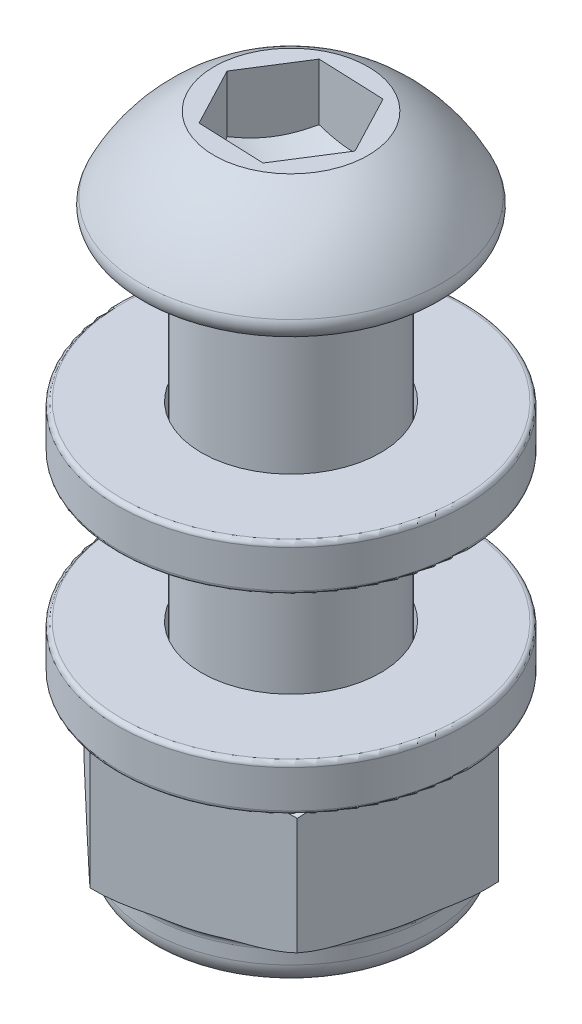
ISO-10303-21;
HEADER;
FILE_DESCRIPTION(('STEP AP214'),'2;1');
FILE_NAME('part.step','',(''),(''),'','','');
FILE_SCHEMA(('AUTOMOTIVE_DESIGN { 1 0 10303 214 1 1 1 1 }'));
ENDSEC;
DATA;
#1=APPLICATION_CONTEXT('core data for automotive mechanical design processes');
#2=APPLICATION_PROTOCOL_DEFINITION('international standard','automotive_design',2000,#1);
#3=PRODUCT_CONTEXT('',#1,'mechanical');
#4=PRODUCT('Part','Part','',(#3));
#5=PRODUCT_RELATED_PRODUCT_CATEGORY('part','',(#4));
#6=PRODUCT_DEFINITION_FORMATION('','',#4);
#7=PRODUCT_DEFINITION_CONTEXT('part definition',#1,'design');
#8=PRODUCT_DEFINITION('design','',#6,#7);
#9=PRODUCT_DEFINITION_SHAPE('','',#8);
#10=(LENGTH_UNIT() NAMED_UNIT(*) SI_UNIT(.MILLI.,.METRE.));
#11=(NAMED_UNIT(*) PLANE_ANGLE_UNIT() SI_UNIT($,.RADIAN.));
#12=(NAMED_UNIT(*) SI_UNIT($,.STERADIAN.) SOLID_ANGLE_UNIT());
#13=UNCERTAINTY_MEASURE_WITH_UNIT(LENGTH_MEASURE(1.E-05),#10,'distance_accuracy_value','');
#14=(GEOMETRIC_REPRESENTATION_CONTEXT(3) GLOBAL_UNCERTAINTY_ASSIGNED_CONTEXT((#13)) GLOBAL_UNIT_ASSIGNED_CONTEXT((#10,
#11,#12)) REPRESENTATION_CONTEXT('',''));
#15=CARTESIAN_POINT('',(0.,0.,0.));
#16=DIRECTION('',(0.,0.,1.));
#17=DIRECTION('',(1.,0.,0.));
#18=AXIS2_PLACEMENT_3D('',#15,#16,#17);
#19=CARTESIAN_POINT('',(0.,6.6,0.));
#20=DIRECTION('',(0.,1.,0.));
#21=DIRECTION('',(0.,0.,1.));
#22=AXIS2_PLACEMENT_3D('',#19,#20,#21);
#23=CYLINDRICAL_SURFACE('',#22,3.1);
#24=CARTESIAN_POINT('',(0.,-7.,0.));
#25=DIRECTION('',(0.,1.,0.));
#26=DIRECTION('',(0.,0.,1.));
#27=AXIS2_PLACEMENT_3D('',#24,#25,#26);
#28=CIRCLE('',#27,3.1);
#29=CARTESIAN_POINT('',(0.,-7.,3.1));
#30=VERTEX_POINT('',#29);
#31=EDGE_CURVE('E11',#30,#30,#28,.T.);
#32=ORIENTED_EDGE('',*,*,#31,.F.);
#33=EDGE_LOOP('',(#32));
#34=FACE_BOUND('',#33,.T.);
#35=CARTESIAN_POINT('',(0.,-5.4,0.));
#36=DIRECTION('',(0.,1.,0.));
#37=DIRECTION('',(0.,0.,1.));
#38=AXIS2_PLACEMENT_3D('',#35,#36,#37);
#39=CIRCLE('',#38,3.1);
#40=CARTESIAN_POINT('',(0.,-5.4,3.1));
#41=VERTEX_POINT('',#40);
#42=EDGE_CURVE('E67',#41,#41,#39,.T.);
#43=ORIENTED_EDGE('',*,*,#42,.T.);
#44=EDGE_LOOP('',(#43));
#45=FACE_BOUND('',#44,.T.);
#46=ADVANCED_FACE('F45',(#34,#45),#23,.F.);
#47=CARTESIAN_POINT('',(3.1,-7.,0.));
#48=DIRECTION('',(0.,1.,0.));
#49=DIRECTION('',(0.,0.,1.));
#50=AXIS2_PLACEMENT_3D('',#47,#48,#49);
#51=PLANE('',#50);
#52=CARTESIAN_POINT('',(0.,-7.,0.));
#53=DIRECTION('',(0.,1.,0.));
#54=DIRECTION('',(0.,0.,1.));
#55=AXIS2_PLACEMENT_3D('',#52,#53,#54);
#56=CIRCLE('',#55,5.85);
#57=CARTESIAN_POINT('',(0.,-7.,5.85));
#58=VERTEX_POINT('',#57);
#59=EDGE_CURVE('E51',#58,#58,#56,.T.);
#60=ORIENTED_EDGE('',*,*,#59,.F.);
#61=EDGE_LOOP('',(#60));
#62=FACE_BOUND('',#61,.T.);
#63=ORIENTED_EDGE('',*,*,#31,.T.);
#64=EDGE_LOOP('',(#63));
#65=FACE_BOUND('',#64,.T.);
#66=ADVANCED_FACE('F92',(#62,#65),#51,.F.);
#67=CARTESIAN_POINT('',(0.,-6.85,0.));
#68=DIRECTION('',(0.,1.,0.));
#69=DIRECTION('',(0.,0.,1.));
#70=AXIS2_PLACEMENT_3D('',#67,#68,#69);
#71=TOROIDAL_SURFACE('',#70,5.85,0.150000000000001);
#72=CARTESIAN_POINT('',(0.,-6.85,0.));
#73=DIRECTION('',(0.,1.,0.));
#74=DIRECTION('',(0.,0.,1.));
#75=AXIS2_PLACEMENT_3D('',#72,#73,#74);
#76=CIRCLE('',#75,6.);
#77=CARTESIAN_POINT('',(0.,-6.85,6.));
#78=VERTEX_POINT('',#77);
#79=EDGE_CURVE('E55',#78,#78,#76,.T.);
#80=ORIENTED_EDGE('',*,*,#79,.F.);
#81=EDGE_LOOP('',(#80));
#82=FACE_BOUND('',#81,.T.);
#83=ORIENTED_EDGE('',*,*,#59,.T.);
#84=EDGE_LOOP('',(#83));
#85=FACE_BOUND('',#84,.T.);
#86=ADVANCED_FACE('F87',(#82,#85),#71,.T.);
#87=CARTESIAN_POINT('',(0.,6.6,0.));
#88=DIRECTION('',(0.,1.,0.));
#89=DIRECTION('',(0.,0.,1.));
#90=AXIS2_PLACEMENT_3D('',#87,#88,#89);
#91=CYLINDRICAL_SURFACE('',#90,6.);
#92=CARTESIAN_POINT('',(0.,-5.55,0.));
#93=DIRECTION('',(0.,1.,0.));
#94=DIRECTION('',(0.,0.,1.));
#95=AXIS2_PLACEMENT_3D('',#92,#93,#94);
#96=CIRCLE('',#95,6.);
#97=CARTESIAN_POINT('',(0.,-5.55,6.));
#98=VERTEX_POINT('',#97);
#99=EDGE_CURVE('E59',#98,#98,#96,.T.);
#100=ORIENTED_EDGE('',*,*,#99,.F.);
#101=EDGE_LOOP('',(#100));
#102=FACE_BOUND('',#101,.T.);
#103=ORIENTED_EDGE('',*,*,#79,.T.);
#104=EDGE_LOOP('',(#103));
#105=FACE_BOUND('',#104,.T.);
#106=ADVANCED_FACE('F81',(#102,#105),#91,.T.);
#107=CARTESIAN_POINT('',(0.,-5.55,0.));
#108=DIRECTION('',(0.,1.,0.));
#109=DIRECTION('',(0.,0.,1.));
#110=AXIS2_PLACEMENT_3D('',#107,#108,#109);
#111=TOROIDAL_SURFACE('',#110,5.85,0.15);
#112=CARTESIAN_POINT('',(0.,-5.4,0.));
#113=DIRECTION('',(0.,1.,0.));
#114=DIRECTION('',(0.,0.,1.));
#115=AXIS2_PLACEMENT_3D('',#112,#113,#114);
#116=CIRCLE('',#115,5.85);
#117=CARTESIAN_POINT('',(0.,-5.4,5.85));
#118=VERTEX_POINT('',#117);
#119=EDGE_CURVE('E64',#118,#118,#116,.T.);
#120=ORIENTED_EDGE('',*,*,#119,.F.);
#121=EDGE_LOOP('',(#120));
#122=FACE_BOUND('',#121,.T.);
#123=ORIENTED_EDGE('',*,*,#99,.T.);
#124=EDGE_LOOP('',(#123));
#125=FACE_BOUND('',#124,.T.);
#126=ADVANCED_FACE('F75',(#122,#125),#111,.T.);
#127=CARTESIAN_POINT('',(3.1,-5.4,0.));
#128=DIRECTION('',(0.,-1.,0.));
#129=DIRECTION('',(0.,0.,-1.));
#130=AXIS2_PLACEMENT_3D('',#127,#128,#129);
#131=PLANE('',#130);
#132=ORIENTED_EDGE('',*,*,#42,.F.);
#133=EDGE_LOOP('',(#132));
#134=FACE_BOUND('',#133,.T.);
#135=ORIENTED_EDGE('',*,*,#119,.T.);
#136=EDGE_LOOP('',(#135));
#137=FACE_BOUND('',#136,.T.);
#138=ADVANCED_FACE('F72',(#134,#137),#131,.F.);
#139=CLOSED_SHELL('',(#46,#66,#86,#106,#126,#138));
#140=MANIFOLD_SOLID_BREP('B2_NOT_SHOWN',#139);
#141=CARTESIAN_POINT('',(0.,-18.3879302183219,0.));
#142=DIRECTION('',(0.,1.,0.));
#143=DIRECTION('',(0.,0.,1.));
#144=AXIS2_PLACEMENT_3D('',#141,#142,#143);
#145=TOROIDAL_SURFACE('',#144,5.19999999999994,0.299999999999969);
#146=CARTESIAN_POINT('',(0.,-18.3879302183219,0.));
#147=DIRECTION('',(0.,1.,0.));
#148=DIRECTION('',(0.,0.,1.));
#149=AXIS2_PLACEMENT_3D('',#146,#147,#148);
#150=CIRCLE('',#149,4.9);
#151=CARTESIAN_POINT('',(0.,-18.3879302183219,4.9));
#152=VERTEX_POINT('',#151);
#153=EDGE_CURVE('E413',#152,#152,#150,.T.);
#154=ORIENTED_EDGE('',*,*,#153,.T.);
#155=EDGE_LOOP('',(#154));
#156=FACE_BOUND('',#155,.T.);
#157=CARTESIAN_POINT('',(-4.55890947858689,-18.0899023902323,-2.42906583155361));
#158=CARTESIAN_POINT('',(-4.57059896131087,-18.0913592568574,-2.38037553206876));
#159=CARTESIAN_POINT('',(-4.58228139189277,-18.0935281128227,-2.33171460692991));
#160=CARTESIAN_POINT('',(-4.60562484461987,-18.09889223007,-2.23448192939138));
#161=CARTESIAN_POINT('',(-4.61728587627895,-18.1020867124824,-2.18591013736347));
#162=CARTESIAN_POINT('',(-4.64058363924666,-18.1091039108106,-2.08886777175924));
#163=CARTESIAN_POINT('',(-4.65222038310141,-18.1129259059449,-2.04039714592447));
#164=CARTESIAN_POINT('',(-4.67549478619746,-18.1208350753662,-1.94345208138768));
#165=CARTESIAN_POINT('',(-4.68713244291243,-18.1249223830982,-1.89497765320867));
#166=CARTESIAN_POINT('',(-4.71620953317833,-18.1350006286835,-1.77386260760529));
#167=CARTESIAN_POINT('',(-4.7336503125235,-18.1409252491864,-1.70121638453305));
#168=CARTESIAN_POINT('',(-4.76855557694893,-18.1512909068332,-1.55582519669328));
#169=CARTESIAN_POINT('',(-4.78602005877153,-18.1557321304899,-1.4830802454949));
#170=CARTESIAN_POINT('',(-4.82095893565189,-18.1620480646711,-1.33754905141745));
#171=CARTESIAN_POINT('',(-4.83843330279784,-18.163925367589,-1.26476292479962));
#172=CARTESIAN_POINT('',(-4.87338474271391,-18.1646056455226,-1.11917940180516));
#173=CARTESIAN_POINT('',(-4.89086181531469,-18.1634087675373,-1.04638200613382));
#174=CARTESIAN_POINT('',(-4.92578321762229,-18.1582760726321,-0.900923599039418));
#175=CARTESIAN_POINT('',(-4.94322755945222,-18.1543416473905,-0.828262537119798));
#176=CARTESIAN_POINT('',(-4.97809080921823,-18.144723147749,-0.683046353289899));
#177=CARTESIAN_POINT('',(-4.99550971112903,-18.1390387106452,-0.610491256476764));
#178=CARTESIAN_POINT('',(-5.04777698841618,-18.1211866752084,-0.392781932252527));
#179=CARTESIAN_POINT('',(-5.0826129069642,-18.108226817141,-0.247679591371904));
#180=CARTESIAN_POINT('',(-5.1252815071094,-18.0971940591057,-0.069951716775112));
#181=CARTESIAN_POINT('',(-5.13305544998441,-18.0953799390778,-0.0375708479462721));
#182=CARTESIAN_POINT('',(-5.14860681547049,-18.0922650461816,0.0272053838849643));
#183=CARTESIAN_POINT('',(-5.15638423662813,-18.0909641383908,0.0596007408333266));
#184=CARTESIAN_POINT('',(-5.16416411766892,-18.0899807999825,0.0920063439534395));
#185=B_SPLINE_CURVE_WITH_KNOTS('',3,(#157,#158,#159,#160,#161,#162,#163,#164,#165,#166,#167,
#168,#169,#170,#171,#172,#173,#174,#175,#176,#177,#178,#179,#180,#181,#182,#183,#184),
.UNSPECIFIED.,.F.,.F.,(4,2,2,2,2,2,2,2,2,2,2,2,2,4),(0.,0.150266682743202,0.300419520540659,
0.450401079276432,0.600458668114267,0.825290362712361,1.05009377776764,1.27466972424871,
1.49923493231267,1.72368606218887,1.94818374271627,2.39747568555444,2.49752213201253,
2.59754225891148),.UNSPECIFIED.);
#186=CARTESIAN_POINT('',(-4.5604868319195,-18.0901023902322,-2.42249566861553));
#187=VERTEX_POINT('',#186);
#188=CARTESIAN_POINT('',(-5.16321345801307,-18.0901023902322,0.0880465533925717));
#189=VERTEX_POINT('',#188);
#190=EDGE_CURVE('E387',#187,#189,#185,.T.);
#191=ORIENTED_EDGE('',*,*,#190,.F.);
#192=CARTESIAN_POINT('',(0.,-18.0901023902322,0.));
#193=DIRECTION('',(0.,1.,0.));
#194=DIRECTION('',(0.,0.,1.));
#195=AXIS2_PLACEMENT_3D('',#192,#193,#194);
#196=CIRCLE('',#195,5.16396411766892);
#197=CARTESIAN_POINT('',(-2.6578572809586,-18.0901023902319,-4.42745074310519));
#198=VERTEX_POINT('',#197);
#199=EDGE_CURVE('E537',#198,#187,#196,.T.);
#200=ORIENTED_EDGE('',*,*,#199,.F.);
#201=CARTESIAN_POINT('',(-0.175822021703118,-18.0899023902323,-5.16266433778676));
#202=CARTESIAN_POINT('',(-0.22383397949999,-18.0913592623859,-5.14844252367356));
#203=CARTESIAN_POINT('',(-0.271816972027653,-18.0935281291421,-5.13422928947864));
#204=CARTESIAN_POINT('',(-0.367695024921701,-18.0988922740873,-5.10582886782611));
#205=CARTESIAN_POINT('',(-0.415590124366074,-18.1020867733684,-5.09164166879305));
#206=CARTESIAN_POINT('',(-0.511280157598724,-18.109103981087,-5.06329694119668));
#207=CARTESIAN_POINT('',(-0.559075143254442,-18.1129259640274,-5.04913939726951));
#208=CARTESIAN_POINT('',(-0.65466887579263,-18.1208351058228,-5.02082319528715));
#209=CARTESIAN_POINT('',(-0.702467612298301,-18.1249223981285,-5.00666454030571));
#210=CARTESIAN_POINT('',(-0.821894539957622,-18.1350006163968,-4.97128861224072));
#211=CARTESIAN_POINT('',(-0.893528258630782,-18.1409252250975,-4.9500697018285));
#212=CARTESIAN_POINT('',(-1.03689306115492,-18.1512908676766,-4.9076030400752));
#213=CARTESIAN_POINT('',(-1.10862413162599,-18.1557320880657,-4.88635529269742));
#214=CARTESIAN_POINT('',(-1.25212697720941,-18.1620480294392,-4.84384774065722));
#215=CARTESIAN_POINT('',(-1.323898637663,-18.1639253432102,-4.82258796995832));
#216=CARTESIAN_POINT('',(-1.46745307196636,-18.1646056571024,-4.78006513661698));
#217=CARTESIAN_POINT('',(-1.53923584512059,-18.1634088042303,-4.75880207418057));
#218=CARTESIAN_POINT('',(-1.6826671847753,-18.1582761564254,-4.7163157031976));
#219=CARTESIAN_POINT('',(-1.75431580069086,-18.1543417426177,-4.69509238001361));
#220=CARTESIAN_POINT('',(-1.89750857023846,-18.1447232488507,-4.65267667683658));
#221=CARTESIAN_POINT('',(-1.96905269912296,-18.1390388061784,-4.63148430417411));
#222=CARTESIAN_POINT('',(-2.18372862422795,-18.1211867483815,-4.56789428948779));
#223=CARTESIAN_POINT('',(-2.3268092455,-18.108226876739,-4.52551180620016));
#224=CARTESIAN_POINT('',(-2.5024892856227,-18.097167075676,-4.47347291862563));
#225=CARTESIAN_POINT('',(-2.53484775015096,-18.095331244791,-4.46388788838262));
#226=CARTESIAN_POINT('',(-2.59957933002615,-18.0921885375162,-4.44471348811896));
#227=CARTESIAN_POINT('',(-2.63195243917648,-18.0908815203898,-4.43512411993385));
#228=CARTESIAN_POINT('',(-2.66433588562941,-18.0899023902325,-4.42553168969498));
#229=B_SPLINE_CURVE_WITH_KNOTS('',3,(#201,#202,#203,#204,#205,#206,#207,#208,#209,#210,#211,
#212,#213,#214,#215,#216,#217,#218,#219,#220,#221,#222,#223,#224,#225,#226,#227,#228),
.UNSPECIFIED.,.F.,.F.,(4,2,2,2,2,2,2,2,2,2,2,2,2,4),(0.,0.150267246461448,0.300420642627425,
0.450401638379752,0.600458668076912,0.825289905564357,1.05009286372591,1.27466831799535,
1.49923303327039,1.72368453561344,1.94818258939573,2.3974756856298,2.49886527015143,
2.60022785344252),.UNSPECIFIED.);
#230=CARTESIAN_POINT('',(-0.182300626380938,-18.0901023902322,-5.16074528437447));
#231=VERTEX_POINT('',#230);
#232=EDGE_CURVE('E350',#231,#198,#229,.T.);
#233=ORIENTED_EDGE('',*,*,#232,.F.);
#234=CARTESIAN_POINT('',(2.50535617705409,-18.0901023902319,-4.51549729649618));
#235=VERTEX_POINT('',#234);
#236=EDGE_CURVE('E540',#235,#231,#196,.T.);
#237=ORIENTED_EDGE('',*,*,#236,.F.);
#238=CARTESIAN_POINT('',(4.38308745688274,-18.0899023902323,-2.73359850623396));
#239=CARTESIAN_POINT('',(4.34676502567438,-18.0913592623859,-2.76806717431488));
#240=CARTESIAN_POINT('',(4.31046450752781,-18.0935281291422,-2.80251504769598));
#241=CARTESIAN_POINT('',(4.2379299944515,-18.0988922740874,-2.87134766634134));
#242=CARTESIAN_POINT('',(4.20169596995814,-18.1020867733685,-2.90573243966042));
#243=CARTESIAN_POINT('',(4.12930369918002,-18.1091039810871,-2.97443007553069));
#244=CARTESIAN_POINT('',(4.09314541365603,-18.1129259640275,-3.00874297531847));
#245=CARTESIAN_POINT('',(4.02082599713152,-18.120835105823,-3.07737147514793));
#246=CARTESIAN_POINT('',(3.98466487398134,-18.1249223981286,-3.11168706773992));
#247=CARTESIAN_POINT('',(3.89431495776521,-18.1350006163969,-3.19742585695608));
#248=CARTESIAN_POINT('',(3.84012198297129,-18.1409252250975,-3.24885302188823));
#249=CARTESIAN_POINT('',(3.73166237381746,-18.1512908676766,-3.35177725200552));
#250=CARTESIAN_POINT('',(3.67739574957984,-18.1557320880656,-3.40327430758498));
#251=CARTESIAN_POINT('',(3.56883170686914,-18.1620480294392,-3.50629764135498));
#252=CARTESIAN_POINT('',(3.51453437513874,-18.1639253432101,-3.55782383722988));
#253=CARTESIAN_POINT('',(3.40593130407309,-18.1646056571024,-3.66088420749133));
#254=CARTESIAN_POINT('',(3.35162556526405,-18.1634088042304,-3.71241838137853));
#255=CARTESIAN_POINT('',(3.24311561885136,-18.1582761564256,-3.81539037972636));
#256=CARTESIAN_POINT('',(3.18891137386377,-18.1543417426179,-3.86682823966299));
#257=CARTESIAN_POINT('',(3.0805819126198,-18.144723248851,-3.96962896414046));
#258=CARTESIAN_POINT('',(3.02645671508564,-18.1390388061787,-4.02099181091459));
#259=CARTESIAN_POINT('',(2.86404818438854,-18.1211867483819,-4.17511160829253));
#260=CARTESIAN_POINT('',(2.75580356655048,-18.1082268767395,-4.27783181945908));
#261=CARTESIAN_POINT('',(2.62289654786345,-18.0971670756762,-4.40395575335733));
#262=CARTESIAN_POINT('',(2.59841643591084,-18.0953312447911,-4.42718649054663));
#263=CARTESIAN_POINT('',(2.54944512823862,-18.0921885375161,-4.47365848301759));
#264=CARTESIAN_POINT('',(2.52495393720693,-18.0908815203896,-4.49689973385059));
#265=CARTESIAN_POINT('',(2.50045492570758,-18.0899023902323,-4.52014840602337));
#266=B_SPLINE_CURVE_WITH_KNOTS('',3,(#238,#239,#240,#241,#242,#243,#244,#245,#246,#247,#248,
#249,#250,#251,#252,#253,#254,#255,#256,#257,#258,#259,#260,#261,#262,#263,#264,#265),
.UNSPECIFIED.,.F.,.F.,(4,2,2,2,2,2,2,2,2,2,2,2,2,4),(0.,0.150267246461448,0.300420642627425,
0.450401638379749,0.600458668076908,0.825289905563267,1.05009286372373,1.27466831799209,
1.49923303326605,1.72368453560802,1.94818258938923,2.39747568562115,2.498865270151,
2.6002278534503),.UNSPECIFIED.);
#267=CARTESIAN_POINT('',(4.37818620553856,-18.0901023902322,-2.73824961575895));
#268=VERTEX_POINT('',#267);
#269=EDGE_CURVE('E343',#268,#235,#266,.T.);
#270=ORIENTED_EDGE('',*,*,#269,.F.);
#271=CARTESIAN_POINT('',(5.16321345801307,-18.0901023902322,-0.0880465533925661));
#272=VERTEX_POINT('',#271);
#273=EDGE_CURVE('E153',#272,#268,#196,.T.);
#274=ORIENTED_EDGE('',*,*,#273,.F.);
#275=CARTESIAN_POINT('',(4.55890947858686,-18.0899023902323,2.42906583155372));
#276=CARTESIAN_POINT('',(4.57059896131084,-18.0913592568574,2.38037553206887));
#277=CARTESIAN_POINT('',(4.58228139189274,-18.0935281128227,2.33171460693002));
#278=CARTESIAN_POINT('',(4.60562484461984,-18.09889223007,2.23448192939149));
#279=CARTESIAN_POINT('',(4.61728587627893,-18.1020867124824,2.18591013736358));
#280=CARTESIAN_POINT('',(4.64058363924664,-18.1091039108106,2.08886777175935));
#281=CARTESIAN_POINT('',(4.65222038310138,-18.1129259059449,2.04039714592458));
#282=CARTESIAN_POINT('',(4.67549478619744,-18.1208350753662,1.94345208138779));
#283=CARTESIAN_POINT('',(4.6871324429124,-18.1249223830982,1.89497765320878));
#284=CARTESIAN_POINT('',(4.71620953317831,-18.1350006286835,1.77386260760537));
#285=CARTESIAN_POINT('',(4.73365031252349,-18.1409252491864,1.7012163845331));
#286=CARTESIAN_POINT('',(4.76855557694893,-18.1512909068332,1.55582519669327));
#287=CARTESIAN_POINT('',(4.78602005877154,-18.1557321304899,1.48308024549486));
#288=CARTESIAN_POINT('',(4.82095893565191,-18.1620480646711,1.33754905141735));
#289=CARTESIAN_POINT('',(4.83843330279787,-18.163925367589,1.26476292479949));
#290=CARTESIAN_POINT('',(4.87338474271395,-18.1646056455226,1.11917940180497));
#291=CARTESIAN_POINT('',(4.89086181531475,-18.1634087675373,1.04638200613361));
#292=CARTESIAN_POINT('',(4.92578321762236,-18.1582760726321,0.900923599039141));
#293=CARTESIAN_POINT('',(4.9432275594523,-18.1543416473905,0.828262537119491));
#294=CARTESIAN_POINT('',(4.97809080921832,-18.144723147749,0.683046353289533));
#295=CARTESIAN_POINT('',(4.99550971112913,-18.1390387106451,0.610491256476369));
#296=CARTESIAN_POINT('',(5.04777698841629,-18.1211866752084,0.392781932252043));
#297=CARTESIAN_POINT('',(5.08261290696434,-18.1082268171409,0.24767959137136));
#298=CARTESIAN_POINT('',(5.12528150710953,-18.0971940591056,0.0699517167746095));
#299=CARTESIAN_POINT('',(5.13305544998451,-18.0953799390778,0.0375708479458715));
#300=CARTESIAN_POINT('',(5.14860681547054,-18.0922650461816,-0.0272053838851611));
#301=CARTESIAN_POINT('',(5.15638423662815,-18.0909641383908,-0.0596007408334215));
#302=CARTESIAN_POINT('',(5.16416411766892,-18.0899807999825,-0.0920063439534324));
#303=B_SPLINE_CURVE_WITH_KNOTS('',3,(#275,#276,#277,#278,#279,#280,#281,#282,#283,#284,#285,
#286,#287,#288,#289,#290,#291,#292,#293,#294,#295,#296,#297,#298,#299,#300,#301,#302),
.UNSPECIFIED.,.F.,.F.,(4,2,2,2,2,2,2,2,2,2,2,2,2,4),(0.,0.150266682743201,0.300419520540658,
0.450401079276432,0.600458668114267,0.825290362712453,1.05009377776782,1.27466972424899,
1.49923493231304,1.72368606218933,1.94818374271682,2.39747568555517,2.49752213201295,
2.59754225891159),.UNSPECIFIED.);
#304=CARTESIAN_POINT('',(4.5604868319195,-18.0901023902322,2.42249566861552));
#305=VERTEX_POINT('',#304);
#306=EDGE_CURVE('E318',#305,#272,#303,.T.);
#307=ORIENTED_EDGE('',*,*,#306,.F.);
#308=CARTESIAN_POINT('',(2.6578572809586,-18.0901023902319,4.42745074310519));
#309=VERTEX_POINT('',#308);
#310=EDGE_CURVE('E43',#309,#305,#196,.T.);
#311=ORIENTED_EDGE('',*,*,#310,.F.);
#312=CARTESIAN_POINT('',(0.175822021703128,-18.0899023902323,5.16266433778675));
#313=CARTESIAN_POINT('',(0.223833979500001,-18.0913592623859,5.14844252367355));
#314=CARTESIAN_POINT('',(0.271816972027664,-18.0935281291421,5.13422928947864));
#315=CARTESIAN_POINT('',(0.367695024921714,-18.0988922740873,5.10582886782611));
#316=CARTESIAN_POINT('',(0.415590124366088,-18.1020867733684,5.09164166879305));
#317=CARTESIAN_POINT('',(0.511280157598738,-18.109103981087,5.06329694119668));
#318=CARTESIAN_POINT('',(0.559075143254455,-18.1129259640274,5.04913939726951));
#319=CARTESIAN_POINT('',(0.654668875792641,-18.1208351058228,5.02082319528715));
#320=CARTESIAN_POINT('',(0.702467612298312,-18.1249223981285,5.0066645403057));
#321=CARTESIAN_POINT('',(0.821894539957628,-18.1350006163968,4.97128861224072));
#322=CARTESIAN_POINT('',(0.893528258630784,-18.1409252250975,4.9500697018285));
#323=CARTESIAN_POINT('',(1.03689306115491,-18.1512908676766,4.9076030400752));
#324=CARTESIAN_POINT('',(1.10862413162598,-18.1557320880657,4.88635529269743));
#325=CARTESIAN_POINT('',(1.25212697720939,-18.1620480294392,4.84384774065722));
#326=CARTESIAN_POINT('',(1.32389863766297,-18.1639253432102,4.82258796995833));
#327=CARTESIAN_POINT('',(1.46745307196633,-18.1646056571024,4.78006513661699));
#328=CARTESIAN_POINT('',(1.53923584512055,-18.1634088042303,4.75880207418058));
#329=CARTESIAN_POINT('',(1.68266718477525,-18.1582761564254,4.71631570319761));
#330=CARTESIAN_POINT('',(1.75431580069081,-18.1543417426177,4.69509238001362));
#331=CARTESIAN_POINT('',(1.89750857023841,-18.1447232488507,4.6526766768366));
#332=CARTESIAN_POINT('',(1.9690526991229,-18.1390388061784,4.63148430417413));
#333=CARTESIAN_POINT('',(2.18372862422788,-18.1211867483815,4.56789428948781));
#334=CARTESIAN_POINT('',(2.32680924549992,-18.108226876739,4.52551180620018));
#335=CARTESIAN_POINT('',(2.50248928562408,-18.0971670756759,4.47347291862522));
#336=CARTESIAN_POINT('',(2.5348477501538,-18.0953312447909,4.46388788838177));
#337=CARTESIAN_POINT('',(2.59957933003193,-18.092188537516,4.44471348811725));
#338=CARTESIAN_POINT('',(2.63195243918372,-18.0908815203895,4.43512411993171));
#339=CARTESIAN_POINT('',(2.66433588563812,-18.0899023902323,4.4255316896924));
#340=B_SPLINE_CURVE_WITH_KNOTS('',3,(#312,#313,#314,#315,#316,#317,#318,#319,#320,#321,#322,
#323,#324,#325,#326,#327,#328,#329,#330,#331,#332,#333,#334,#335,#336,#337,#338,#339),
.UNSPECIFIED.,.F.,.F.,(4,2,2,2,2,2,2,2,2,2,2,2,2,4),(0.,0.15026724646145,0.300420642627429,
0.450401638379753,0.600458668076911,0.825289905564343,1.05009286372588,1.27466831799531,
1.49923303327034,1.72368453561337,1.94818258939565,2.3974756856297,2.49886527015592,
2.6002278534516),.UNSPECIFIED.);
#341=CARTESIAN_POINT('',(0.182300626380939,-18.0901023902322,5.16074528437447));
#342=VERTEX_POINT('',#341);
#343=EDGE_CURVE('E271',#342,#309,#340,.T.);
#344=ORIENTED_EDGE('',*,*,#343,.F.);
#345=CARTESIAN_POINT('',(-2.50535617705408,-18.0901023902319,4.51549729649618));
#346=VERTEX_POINT('',#345);
#347=EDGE_CURVE('E148',#346,#342,#196,.T.);
#348=ORIENTED_EDGE('',*,*,#347,.F.);
#349=CARTESIAN_POINT('',(-4.38308745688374,-18.0899023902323,2.73359850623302));
#350=CARTESIAN_POINT('',(-4.34676502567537,-18.0913592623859,2.76806717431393));
#351=CARTESIAN_POINT('',(-4.3104645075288,-18.0935281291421,2.80251504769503));
#352=CARTESIAN_POINT('',(-4.2379299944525,-18.0988922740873,2.8713476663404));
#353=CARTESIAN_POINT('',(-4.20169596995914,-18.1020867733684,2.90573243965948));
#354=CARTESIAN_POINT('',(-4.12930369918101,-18.109103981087,2.97443007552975));
#355=CARTESIAN_POINT('',(-4.09314541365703,-18.1129259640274,3.00874297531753));
#356=CARTESIAN_POINT('',(-4.02082599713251,-18.1208351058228,3.07737147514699));
#357=CARTESIAN_POINT('',(-3.98466487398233,-18.1249223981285,3.11168706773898));
#358=CARTESIAN_POINT('',(-3.89431495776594,-18.1350006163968,3.19742585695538));
#359=CARTESIAN_POINT('',(-3.84012198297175,-18.1409252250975,3.24885302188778));
#360=CARTESIAN_POINT('',(-3.7316623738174,-18.1512908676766,3.35177725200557));
#361=CARTESIAN_POINT('',(-3.67739574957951,-18.1557320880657,3.40327430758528));
#362=CARTESIAN_POINT('',(-3.56883170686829,-18.1620480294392,3.50629764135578));
#363=CARTESIAN_POINT('',(-3.51453437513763,-18.1639253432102,3.55782383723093));
#364=CARTESIAN_POINT('',(-3.40593130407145,-18.1646056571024,3.66088420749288));
#365=CARTESIAN_POINT('',(-3.35162556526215,-18.1634088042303,3.71241838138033));
#366=CARTESIAN_POINT('',(-3.24311561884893,-18.1582761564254,3.81539037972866));
#367=CARTESIAN_POINT('',(-3.18891137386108,-18.1543417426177,3.86682823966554));
#368=CARTESIAN_POINT('',(-3.08058191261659,-18.1447232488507,3.9696289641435));
#369=CARTESIAN_POINT('',(-3.02645671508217,-18.1390388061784,4.02099181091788));
#370=CARTESIAN_POINT('',(-2.8640481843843,-18.1211867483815,4.17511160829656));
#371=CARTESIAN_POINT('',(-2.75580356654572,-18.108226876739,4.2778318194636));
#372=CARTESIAN_POINT('',(-2.6228965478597,-18.0971670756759,4.40395575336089));
#373=CARTESIAN_POINT('',(-2.59841643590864,-18.095331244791,4.42718649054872));
#374=CARTESIAN_POINT('',(-2.54944512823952,-18.0921885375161,4.47365848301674));
#375=CARTESIAN_POINT('',(-2.52495393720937,-18.0908815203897,4.49689973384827));
#376=CARTESIAN_POINT('',(-2.50045492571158,-18.0899023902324,4.52014840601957));
#377=B_SPLINE_CURVE_WITH_KNOTS('',3,(#349,#350,#351,#352,#353,#354,#355,#356,#357,#358,#359,
#360,#361,#362,#363,#364,#365,#366,#367,#368,#369,#370,#371,#372,#373,#374,#375,#376),
.UNSPECIFIED.,.F.,.F.,(4,2,2,2,2,2,2,2,2,2,2,2,2,4),(0.,0.150267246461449,0.300420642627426,
0.450401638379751,0.600458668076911,0.825289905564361,1.05009286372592,1.27466831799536,
1.49923303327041,1.72368453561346,1.94818258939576,2.39747568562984,2.49886527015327,
2.60022785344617),.UNSPECIFIED.);
#378=CARTESIAN_POINT('',(-4.37818620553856,-18.0901023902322,2.73824961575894));
#379=VERTEX_POINT('',#378);
#380=EDGE_CURVE('E255',#379,#346,#377,.T.);
#381=ORIENTED_EDGE('',*,*,#380,.F.);
#382=EDGE_CURVE('E441',#189,#379,#196,.T.);
#383=ORIENTED_EDGE('',*,*,#382,.F.);
#384=EDGE_LOOP('',(#191,#200,#233,#237,#270,#274,#307,#311,#344,#348,#381,#383));
#385=FACE_BOUND('',#384,.T.);
#386=ADVANCED_FACE('F144',(#156,#385),#145,.F.);
#387=CARTESIAN_POINT('',(5.,-15.85,0.));
#388=DIRECTION('',(0.,0.,1.));
#389=DIRECTION('',(0.,1.,0.));
#390=AXIS2_PLACEMENT_3D('',#387,#388,#389);
#391=ELLIPSE('',#390,2.25,1.75);
#392=CARTESIAN_POINT('',(0.,0.,0.));
#393=DIRECTION('',(0.,1.,0.));
#394=AXIS1_PLACEMENT('',#392,#393);
#395=SURFACE_OF_REVOLUTION('',#391,#394);
#396=CARTESIAN_POINT('',(-4.18795273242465,-17.8682821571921,-3.97421504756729));
#397=CARTESIAN_POINT('',(-4.20302365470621,-17.8887312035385,-3.91144000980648));
#398=CARTESIAN_POINT('',(-4.21823000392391,-17.9072608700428,-3.84810087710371));
#399=CARTESIAN_POINT('',(-4.24877768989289,-17.9407962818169,-3.7208603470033));
#400=CARTESIAN_POINT('',(-4.264118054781,-17.9558181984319,-3.65696299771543));
#401=CARTESIAN_POINT('',(-4.29490757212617,-17.9828086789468,-3.52871516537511));
#402=CARTESIAN_POINT('',(-4.31035641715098,-17.9947837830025,-3.46436596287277));
#403=CARTESIAN_POINT('',(-4.34134340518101,-18.0161087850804,-3.33529560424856));
#404=CARTESIAN_POINT('',(-4.35688149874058,-18.0254600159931,-3.27057465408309));
#405=CARTESIAN_POINT('',(-4.38799810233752,-18.0419138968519,-3.14096440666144));
#406=CARTESIAN_POINT('',(-4.40357651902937,-18.0490198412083,-3.07607549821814));
#407=CARTESIAN_POINT('',(-4.43479913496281,-18.06137467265,-2.94602367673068));
#408=CARTESIAN_POINT('',(-4.4504434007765,-18.0666204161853,-2.88086048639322));
#409=CARTESIAN_POINT('',(-4.48179227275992,-18.0755934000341,-2.7502827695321));
#410=CARTESIAN_POINT('',(-4.49749693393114,-18.0793169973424,-2.68486801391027));
#411=CARTESIAN_POINT('',(-4.52896270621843,-18.0855492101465,-2.55380337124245));
#412=CARTESIAN_POINT('',(-4.54472385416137,-18.0880544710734,-2.4881533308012));
#413=CARTESIAN_POINT('',(-4.5604868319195,-18.0901023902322,-2.42249566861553));
#414=B_SPLINE_CURVE_WITH_KNOTS('',3,(#396,#397,#398,#399,#400,#401,#402,#403,#404,#405,#406,
#407,#408,#409,#410,#411,#412,#413),.UNSPECIFIED.,.F.,.F.,(4,2,2,2,2,2,2,2,4),(0.,
0.203092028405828,0.405228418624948,0.606927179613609,0.808523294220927,1.0098222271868,
1.21145973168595,1.41357703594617,1.61624774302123),.UNSPECIFIED.);
#415=CARTESIAN_POINT('',(-4.18795273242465,-17.8682821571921,-3.97421504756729));
#416=VERTEX_POINT('',#415);
#417=EDGE_CURVE('E383',#416,#187,#414,.T.);
#418=ORIENTED_EDGE('',*,*,#417,.F.);
#419=CARTESIAN_POINT('',(-2.65785728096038,-18.0901023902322,-4.42745074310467));
#420=CARTESIAN_POINT('',(-2.72259997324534,-18.0880544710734,-4.40827305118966));
#421=CARTESIAN_POINT('',(-2.78733514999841,-18.0855492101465,-4.38909758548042));
#422=CARTESIAN_POINT('',(-2.91657334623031,-18.0793169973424,-4.350815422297));
#423=CARTESIAN_POINT('',(-2.98107651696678,-18.0755934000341,-4.33170868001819));
#424=CARTESIAN_POINT('',(-3.10983457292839,-18.0666204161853,-4.29356874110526));
#425=CARTESIAN_POINT('',(-3.17408968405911,-18.06137467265,-4.27453547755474));
#426=CARTESIAN_POINT('',(-3.30232917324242,-18.0490198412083,-4.23654914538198));
#427=CARTESIAN_POINT('',(-3.36631382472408,-18.0419138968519,-4.21759599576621));
#428=CARTESIAN_POINT('',(-3.49411789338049,-18.0254600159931,-4.17973864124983));
#429=CARTESIAN_POINT('',(-3.55793692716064,-18.0161087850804,-4.16083454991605));
#430=CARTESIAN_POINT('',(-3.68520863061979,-17.9947837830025,-4.12313488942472));
#431=CARTESIAN_POINT('',(-3.74866109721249,-17.9828086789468,-4.10433938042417));
#432=CARTESIAN_POINT('',(-3.87512173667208,-17.9558181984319,-4.06687996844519));
#433=CARTESIAN_POINT('',(-3.93812864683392,-17.9407962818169,-4.04821643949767));
#434=CARTESIAN_POINT('',(-4.06359602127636,-17.9072608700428,-4.01105124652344));
#435=CARTESIAN_POINT('',(-4.12605249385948,-17.8887312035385,-3.99255076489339));
#436=CARTESIAN_POINT('',(-4.18795273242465,-17.8682821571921,-3.97421504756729));
#437=B_SPLINE_CURVE_WITH_KNOTS('',3,(#419,#420,#421,#422,#423,#424,#425,#426,#427,#428,#429,
#430,#431,#432,#433,#434,#435,#436),.UNSPECIFIED.,.F.,.F.,(4,2,2,2,2,2,2,2,4),(0.,
0.202670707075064,0.404788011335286,0.606425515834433,0.807724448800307,1.00932056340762,
1.21101932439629,1.41315571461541,1.61624774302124),.UNSPECIFIED.);
#438=EDGE_CURVE('E357',#198,#416,#437,.T.);
#439=ORIENTED_EDGE('',*,*,#438,.F.);
#440=ORIENTED_EDGE('',*,*,#199,.T.);
#441=EDGE_LOOP('',(#418,#439,#440));
#442=FACE_BOUND('',#441,.T.);
#443=ADVANCED_FACE('F289',(#442),#395,.T.);
#444=CARTESIAN_POINT('',(1.34779482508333,-17.8682821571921,-5.61398097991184));
#445=CARTESIAN_POINT('',(1.28589458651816,-17.8887312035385,-5.59564526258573));
#446=CARTESIAN_POINT('',(1.22343811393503,-17.9072608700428,-5.57714478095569));
#447=CARTESIAN_POINT('',(1.09797073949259,-17.9407962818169,-5.53997958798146));
#448=CARTESIAN_POINT('',(1.03496382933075,-17.9558181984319,-5.52131605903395));
#449=CARTESIAN_POINT('',(0.90850318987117,-17.9828086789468,-5.48385664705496));
#450=CARTESIAN_POINT('',(0.845050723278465,-17.9947837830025,-5.46506113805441));
#451=CARTESIAN_POINT('',(0.717779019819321,-18.0161087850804,-5.42736147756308));
#452=CARTESIAN_POINT('',(0.653959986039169,-18.0254600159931,-5.4084573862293));
#453=CARTESIAN_POINT('',(0.526155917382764,-18.0419138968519,-5.37060003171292));
#454=CARTESIAN_POINT('',(0.462171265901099,-18.0490198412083,-5.35164688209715));
#455=CARTESIAN_POINT('',(0.333931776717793,-18.06137467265,-5.31366054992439));
#456=CARTESIAN_POINT('',(0.269676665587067,-18.0666204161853,-5.29462728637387));
#457=CARTESIAN_POINT('',(0.140918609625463,-18.0755934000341,-5.25648734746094));
#458=CARTESIAN_POINT('',(0.0764154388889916,-18.0793169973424,-5.23738060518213));
#459=CARTESIAN_POINT('',(-0.0528227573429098,-18.0855492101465,-5.19909844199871));
#460=CARTESIAN_POINT('',(-0.117557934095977,-18.0880544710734,-5.17992297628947));
#461=CARTESIAN_POINT('',(-0.182300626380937,-18.0901023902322,-5.16074528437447));
#462=B_SPLINE_CURVE_WITH_KNOTS('',3,(#444,#445,#446,#447,#448,#449,#450,#451,#452,#453,#454,
#455,#456,#457,#458,#459,#460,#461),.UNSPECIFIED.,.F.,.F.,(4,2,2,2,2,2,2,2,4),(0.,
0.203092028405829,0.405228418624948,0.60692717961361,0.808523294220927,1.0098222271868,
1.21145973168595,1.41357703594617,1.61624774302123),.UNSPECIFIED.);
#463=CARTESIAN_POINT('',(1.34779482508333,-17.8682821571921,-5.61398097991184));
#464=VERTEX_POINT('',#463);
#465=EDGE_CURVE('E358',#464,#231,#462,.T.);
#466=ORIENTED_EDGE('',*,*,#465,.F.);
#467=CARTESIAN_POINT('',(2.50535617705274,-18.0901023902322,-4.51549729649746));
#468=CARTESIAN_POINT('',(2.45637646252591,-18.0880544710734,-4.56197726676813));
#469=CARTESIAN_POINT('',(2.40740243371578,-18.0855492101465,-4.60845184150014));
#470=CARTESIAN_POINT('',(2.30963000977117,-18.0793169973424,-4.70123432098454));
#471=CARTESIAN_POINT('',(2.26083150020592,-18.0755934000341,-4.74754233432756));
#472=CARTESIAN_POINT('',(2.16342231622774,-18.0666204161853,-4.83998011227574));
#473=CARTESIAN_POINT('',(2.1148114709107,-18.06137467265,-4.88611003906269));
#474=CARTESIAN_POINT('',(2.01779459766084,-18.0490198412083,-4.97817552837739));
#475=CARTESIAN_POINT('',(1.96938836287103,-18.0419138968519,-5.02411128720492));
#476=CARTESIAN_POINT('',(1.87270089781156,-18.0254600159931,-5.11586418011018));
#477=CARTESIAN_POINT('',(1.82441995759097,-18.0161087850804,-5.16168103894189));
#478=CARTESIAN_POINT('',(1.72813524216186,-17.9947837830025,-5.25305173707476));
#479=CARTESIAN_POINT('',(1.68013162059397,-17.9828086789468,-5.29860543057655));
#480=CARTESIAN_POINT('',(1.58446049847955,-17.9558181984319,-5.38939385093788));
#481=CARTESIAN_POINT('',(1.53679395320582,-17.9407962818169,-5.43462767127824));
#482=CARTESIAN_POINT('',(1.44187426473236,-17.9072608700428,-5.52470300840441));
#483=CARTESIAN_POINT('',(1.39462414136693,-17.8887312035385,-5.56954165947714));
#484=CARTESIAN_POINT('',(1.34779482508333,-17.8682821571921,-5.61398097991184));
#485=B_SPLINE_CURVE_WITH_KNOTS('',3,(#467,#468,#469,#470,#471,#472,#473,#474,#475,#476,#477,
#478,#479,#480,#481,#482,#483,#484),.UNSPECIFIED.,.F.,.F.,(4,2,2,2,2,2,2,2,4),(0.,
0.202670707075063,0.404788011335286,0.606425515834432,0.807724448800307,1.00932056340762,
1.21101932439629,1.41315571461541,1.61624774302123),.UNSPECIFIED.);
#486=EDGE_CURVE('E500',#235,#464,#485,.T.);
#487=ORIENTED_EDGE('',*,*,#486,.F.);
#488=ORIENTED_EDGE('',*,*,#236,.T.);
#489=EDGE_LOOP('',(#466,#487,#488));
#490=FACE_BOUND('',#489,.T.);
#491=ADVANCED_FACE('F557',(#490),#395,.T.);
#492=CARTESIAN_POINT('',(5.53574755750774,-17.8682821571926,-1.63976593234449));
#493=CARTESIAN_POINT('',(5.48891824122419,-17.8887312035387,-1.68420525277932));
#494=CARTESIAN_POINT('',(5.44166811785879,-17.9072608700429,-1.7290439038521));
#495=CARTESIAN_POINT('',(5.34674842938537,-17.9407962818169,-1.8191192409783));
#496=CARTESIAN_POINT('',(5.29908188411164,-17.955818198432,-1.86435306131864));
#497=CARTESIAN_POINT('',(5.20341076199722,-17.9828086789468,-1.95514148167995));
#498=CARTESIAN_POINT('',(5.15540714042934,-17.9947837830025,-2.00069517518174));
#499=CARTESIAN_POINT('',(5.05912242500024,-18.0161087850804,-2.0920658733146));
#500=CARTESIAN_POINT('',(5.01084148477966,-18.0254600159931,-2.1378827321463));
#501=CARTESIAN_POINT('',(4.9141540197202,-18.0419138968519,-2.22963562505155));
#502=CARTESIAN_POINT('',(4.8657477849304,-18.0490198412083,-2.27557138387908));
#503=CARTESIAN_POINT('',(4.76873091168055,-18.06137467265,-2.36763687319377));
#504=CARTESIAN_POINT('',(4.72012006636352,-18.0666204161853,-2.41376679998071));
#505=CARTESIAN_POINT('',(4.62271088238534,-18.0755934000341,-2.50620457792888));
#506=CARTESIAN_POINT('',(4.5739123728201,-18.0793169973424,-2.55251259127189));
#507=CARTESIAN_POINT('',(4.4761399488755,-18.0855492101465,-2.64529507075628));
#508=CARTESIAN_POINT('',(4.42716592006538,-18.0880544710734,-2.69176964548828));
#509=CARTESIAN_POINT('',(4.37818620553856,-18.0901023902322,-2.73824961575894));
#510=B_SPLINE_CURVE_WITH_KNOTS('',3,(#492,#493,#494,#495,#496,#497,#498,#499,#500,#501,#502,
#503,#504,#505,#506,#507,#508,#509),.UNSPECIFIED.,.F.,.F.,(4,2,2,2,2,2,2,2,4),(0.,
0.203092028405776,0.40522841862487,0.606927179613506,0.808523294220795,1.00982222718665,
1.21145973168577,1.41357703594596,1.616247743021),.UNSPECIFIED.);
#511=CARTESIAN_POINT('',(5.53574755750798,-17.8682821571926,-1.63976593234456));
#512=VERTEX_POINT('',#511);
#513=EDGE_CURVE('E508',#512,#268,#510,.T.);
#514=ORIENTED_EDGE('',*,*,#513,.F.);
#515=CARTESIAN_POINT('',(5.16321345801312,-18.0901023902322,-0.0880465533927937));
#516=CARTESIAN_POINT('',(5.17897643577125,-18.0880544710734,-0.153704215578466));
#517=CARTESIAN_POINT('',(5.19473758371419,-18.0855492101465,-0.21935425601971));
#518=CARTESIAN_POINT('',(5.22620335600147,-18.0793169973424,-0.350418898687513));
#519=CARTESIAN_POINT('',(5.2419080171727,-18.0755934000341,-0.415833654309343));
#520=CARTESIAN_POINT('',(5.27325688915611,-18.0666204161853,-0.546411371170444));
#521=CARTESIAN_POINT('',(5.2889011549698,-18.06137467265,-0.611574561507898));
#522=CARTESIAN_POINT('',(5.32012377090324,-18.0490198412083,-0.74162638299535));
#523=CARTESIAN_POINT('',(5.33570218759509,-18.0419138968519,-0.806515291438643));
#524=CARTESIAN_POINT('',(5.36681879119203,-18.0254600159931,-0.936125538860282));
#525=CARTESIAN_POINT('',(5.3823568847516,-18.0161087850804,-1.00084648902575));
#526=CARTESIAN_POINT('',(5.41334387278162,-17.9947837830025,-1.12991684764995));
#527=CARTESIAN_POINT('',(5.42879271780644,-17.9828086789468,-1.19426605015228));
#528=CARTESIAN_POINT('',(5.4595822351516,-17.955818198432,-1.32251388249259));
#529=CARTESIAN_POINT('',(5.4749226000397,-17.940796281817,-1.38641123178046));
#530=CARTESIAN_POINT('',(5.50547028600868,-17.9072608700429,-1.51365176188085));
#531=CARTESIAN_POINT('',(5.52067663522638,-17.8887312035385,-1.57699089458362));
#532=CARTESIAN_POINT('',(5.53574755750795,-17.8682821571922,-1.63976593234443));
#533=B_SPLINE_CURVE_WITH_KNOTS('',3,(#515,#516,#517,#518,#519,#520,#521,#522,#523,#524,#525,
#526,#527,#528,#529,#530,#531,#532),.UNSPECIFIED.,.F.,.F.,(4,2,2,2,2,2,2,2,4),(0.,
0.202670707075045,0.40478801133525,0.606425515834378,0.807724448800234,1.00932056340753,
1.21101932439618,1.41315571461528,1.61624774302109),.UNSPECIFIED.);
#534=EDGE_CURVE('E323',#272,#512,#533,.T.);
#535=ORIENTED_EDGE('',*,*,#534,.F.);
#536=ORIENTED_EDGE('',*,*,#273,.T.);
#537=EDGE_LOOP('',(#514,#535,#536));
#538=FACE_BOUND('',#537,.T.);
#539=ADVANCED_FACE('F555',(#538),#395,.T.);
#540=CARTESIAN_POINT('',(4.18795273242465,-17.8682821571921,3.97421504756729));
#541=CARTESIAN_POINT('',(4.20302365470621,-17.8887312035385,3.91144000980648));
#542=CARTESIAN_POINT('',(4.21823000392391,-17.9072608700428,3.84810087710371));
#543=CARTESIAN_POINT('',(4.24877768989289,-17.9407962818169,3.7208603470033));
#544=CARTESIAN_POINT('',(4.264118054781,-17.9558181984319,3.65696299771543));
#545=CARTESIAN_POINT('',(4.29490757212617,-17.9828086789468,3.52871516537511));
#546=CARTESIAN_POINT('',(4.31035641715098,-17.9947837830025,3.46436596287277));
#547=CARTESIAN_POINT('',(4.34134340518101,-18.0161087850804,3.33529560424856));
#548=CARTESIAN_POINT('',(4.35688149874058,-18.0254600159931,3.27057465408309));
#549=CARTESIAN_POINT('',(4.38799810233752,-18.0419138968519,3.14096440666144));
#550=CARTESIAN_POINT('',(4.40357651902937,-18.0490198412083,3.07607549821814));
#551=CARTESIAN_POINT('',(4.43479913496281,-18.06137467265,2.94602367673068));
#552=CARTESIAN_POINT('',(4.45044340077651,-18.0666204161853,2.88086048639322));
#553=CARTESIAN_POINT('',(4.48179227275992,-18.0755934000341,2.75028276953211));
#554=CARTESIAN_POINT('',(4.49749693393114,-18.0793169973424,2.68486801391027));
#555=CARTESIAN_POINT('',(4.52896270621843,-18.0855492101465,2.55380337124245));
#556=CARTESIAN_POINT('',(4.54472385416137,-18.0880544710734,2.4881533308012));
#557=CARTESIAN_POINT('',(4.5604868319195,-18.0901023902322,2.42249566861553));
#558=B_SPLINE_CURVE_WITH_KNOTS('',3,(#540,#541,#542,#543,#544,#545,#546,#547,#548,#549,#550,
#551,#552,#553,#554,#555,#556,#557),.UNSPECIFIED.,.F.,.F.,(4,2,2,2,2,2,2,2,4),(0.,
0.203092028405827,0.405228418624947,0.606927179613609,0.808523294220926,1.0098222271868,
1.21145973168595,1.41357703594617,1.61624774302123),.UNSPECIFIED.);
#559=CARTESIAN_POINT('',(4.18795273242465,-17.8682821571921,3.97421504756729));
#560=VERTEX_POINT('',#559);
#561=EDGE_CURVE('E313',#560,#305,#558,.T.);
#562=ORIENTED_EDGE('',*,*,#561,.F.);
#563=CARTESIAN_POINT('',(2.65785728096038,-18.0901023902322,4.42745074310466));
#564=CARTESIAN_POINT('',(2.72259997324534,-18.0880544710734,4.40827305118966));
#565=CARTESIAN_POINT('',(2.78733514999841,-18.0855492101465,4.38909758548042));
#566=CARTESIAN_POINT('',(2.91657334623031,-18.0793169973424,4.350815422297));
#567=CARTESIAN_POINT('',(2.98107651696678,-18.0755934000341,4.33170868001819));
#568=CARTESIAN_POINT('',(3.10983457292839,-18.0666204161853,4.29356874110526));
#569=CARTESIAN_POINT('',(3.17408968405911,-18.06137467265,4.27453547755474));
#570=CARTESIAN_POINT('',(3.30232917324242,-18.0490198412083,4.23654914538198));
#571=CARTESIAN_POINT('',(3.36631382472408,-18.0419138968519,4.21759599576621));
#572=CARTESIAN_POINT('',(3.49411789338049,-18.0254600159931,4.17973864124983));
#573=CARTESIAN_POINT('',(3.55793692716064,-18.0161087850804,4.16083454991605));
#574=CARTESIAN_POINT('',(3.68520863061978,-17.9947837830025,4.12313488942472));
#575=CARTESIAN_POINT('',(3.74866109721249,-17.9828086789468,4.10433938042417));
#576=CARTESIAN_POINT('',(3.87512173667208,-17.9558181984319,4.06687996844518));
#577=CARTESIAN_POINT('',(3.93812864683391,-17.9407962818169,4.04821643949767));
#578=CARTESIAN_POINT('',(4.06359602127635,-17.9072608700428,4.01105124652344));
#579=CARTESIAN_POINT('',(4.12605249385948,-17.8887312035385,3.9925507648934));
#580=CARTESIAN_POINT('',(4.18795273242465,-17.8682821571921,3.97421504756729));
#581=B_SPLINE_CURVE_WITH_KNOTS('',3,(#563,#564,#565,#566,#567,#568,#569,#570,#571,#572,#573,
#574,#575,#576,#577,#578,#579,#580),.UNSPECIFIED.,.F.,.F.,(4,2,2,2,2,2,2,2,4),(0.,
0.202670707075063,0.404788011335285,0.606425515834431,0.807724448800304,1.00932056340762,
1.21101932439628,1.4131557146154,1.61624774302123),.UNSPECIFIED.);
#582=EDGE_CURVE('E273',#309,#560,#581,.T.);
#583=ORIENTED_EDGE('',*,*,#582,.F.);
#584=ORIENTED_EDGE('',*,*,#310,.T.);
#585=EDGE_LOOP('',(#562,#583,#584));
#586=FACE_BOUND('',#585,.T.);
#587=ADVANCED_FACE('F550',(#586),#395,.T.);
#588=CARTESIAN_POINT('',(-1.34779482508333,-17.8682821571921,5.61398097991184));
#589=CARTESIAN_POINT('',(-1.28589458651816,-17.8887312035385,5.59564526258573));
#590=CARTESIAN_POINT('',(-1.22343811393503,-17.9072608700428,5.57714478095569));
#591=CARTESIAN_POINT('',(-1.09797073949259,-17.9407962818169,5.53997958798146));
#592=CARTESIAN_POINT('',(-1.03496382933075,-17.9558181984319,5.52131605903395));
#593=CARTESIAN_POINT('',(-0.908503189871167,-17.9828086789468,5.48385664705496));
#594=CARTESIAN_POINT('',(-0.845050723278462,-17.9947837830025,5.46506113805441));
#595=CARTESIAN_POINT('',(-0.717779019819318,-18.0161087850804,5.42736147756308));
#596=CARTESIAN_POINT('',(-0.653959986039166,-18.0254600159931,5.4084573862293));
#597=CARTESIAN_POINT('',(-0.526155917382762,-18.0419138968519,5.37060003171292));
#598=CARTESIAN_POINT('',(-0.462171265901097,-18.0490198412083,5.35164688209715));
#599=CARTESIAN_POINT('',(-0.333931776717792,-18.06137467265,5.31366054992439));
#600=CARTESIAN_POINT('',(-0.269676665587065,-18.0666204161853,5.29462728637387));
#601=CARTESIAN_POINT('',(-0.140918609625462,-18.0755934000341,5.25648734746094));
#602=CARTESIAN_POINT('',(-0.0764154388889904,-18.0793169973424,5.23738060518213));
#603=CARTESIAN_POINT('',(0.052822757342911,-18.0855492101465,5.19909844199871));
#604=CARTESIAN_POINT('',(0.117557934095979,-18.0880544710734,5.17992297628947));
#605=CARTESIAN_POINT('',(0.182300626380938,-18.0901023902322,5.16074528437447));
#606=B_SPLINE_CURVE_WITH_KNOTS('',3,(#588,#589,#590,#591,#592,#593,#594,#595,#596,#597,#598,
#599,#600,#601,#602,#603,#604,#605),.UNSPECIFIED.,.F.,.F.,(4,2,2,2,2,2,2,2,4),(0.,
0.203092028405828,0.405228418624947,0.60692717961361,0.808523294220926,1.0098222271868,
1.21145973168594,1.41357703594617,1.61624774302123),.UNSPECIFIED.);
#607=CARTESIAN_POINT('',(-1.34779482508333,-17.8682821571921,5.61398097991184));
#608=VERTEX_POINT('',#607);
#609=EDGE_CURVE('E264',#608,#342,#606,.T.);
#610=ORIENTED_EDGE('',*,*,#609,.F.);
#611=CARTESIAN_POINT('',(-2.50535617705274,-18.0901023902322,4.51549729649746));
#612=CARTESIAN_POINT('',(-2.45637646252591,-18.0880544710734,4.56197726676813));
#613=CARTESIAN_POINT('',(-2.40740243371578,-18.0855492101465,4.60845184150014));
#614=CARTESIAN_POINT('',(-2.30963000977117,-18.0793169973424,4.70123432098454));
#615=CARTESIAN_POINT('',(-2.26083150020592,-18.0755934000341,4.74754233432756));
#616=CARTESIAN_POINT('',(-2.16342231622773,-18.0666204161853,4.83998011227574));
#617=CARTESIAN_POINT('',(-2.1148114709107,-18.06137467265,4.88611003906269));
#618=CARTESIAN_POINT('',(-2.01779459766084,-18.0490198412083,4.97817552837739));
#619=CARTESIAN_POINT('',(-1.96938836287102,-18.0419138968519,5.02411128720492));
#620=CARTESIAN_POINT('',(-1.87270089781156,-18.0254600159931,5.11586418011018));
#621=CARTESIAN_POINT('',(-1.82441995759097,-18.0161087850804,5.16168103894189));
#622=CARTESIAN_POINT('',(-1.72813524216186,-17.9947837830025,5.25305173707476));
#623=CARTESIAN_POINT('',(-1.68013162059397,-17.9828086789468,5.29860543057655));
#624=CARTESIAN_POINT('',(-1.58446049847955,-17.9558181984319,5.38939385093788));
#625=CARTESIAN_POINT('',(-1.53679395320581,-17.9407962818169,5.43462767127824));
#626=CARTESIAN_POINT('',(-1.44187426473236,-17.9072608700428,5.52470300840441));
#627=CARTESIAN_POINT('',(-1.39462414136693,-17.8887312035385,5.56954165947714));
#628=CARTESIAN_POINT('',(-1.34779482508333,-17.8682821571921,5.61398097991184));
#629=B_SPLINE_CURVE_WITH_KNOTS('',3,(#611,#612,#613,#614,#615,#616,#617,#618,#619,#620,#621,
#622,#623,#624,#625,#626,#627,#628),.UNSPECIFIED.,.F.,.F.,(4,2,2,2,2,2,2,2,4),(0.,
0.202670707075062,0.404788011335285,0.60642551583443,0.807724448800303,1.00932056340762,
1.21101932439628,1.4131557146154,1.61624774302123),.UNSPECIFIED.);
#630=EDGE_CURVE('E250',#346,#608,#629,.T.);
#631=ORIENTED_EDGE('',*,*,#630,.F.);
#632=ORIENTED_EDGE('',*,*,#347,.T.);
#633=EDGE_LOOP('',(#610,#631,#632));
#634=FACE_BOUND('',#633,.T.);
#635=ADVANCED_FACE('F270',(#634),#395,.T.);
#636=CARTESIAN_POINT('',(-5.53574755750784,-13.8317178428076,1.63976593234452));
#637=CARTESIAN_POINT('',(-5.51877710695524,-13.8086923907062,1.56907877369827));
#638=CARTESIAN_POINT('',(-5.50163689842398,-13.7881014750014,1.49768452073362));
#639=CARTESIAN_POINT('',(-5.46722124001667,-13.7513489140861,1.35433269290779));
#640=CARTESIAN_POINT('',(-5.44994748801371,-13.7351582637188,1.28238219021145));
#641=CARTESIAN_POINT('',(-5.41529313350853,-13.7065167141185,1.13803611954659));
#642=CARTESIAN_POINT('',(-5.39791305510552,-13.6940539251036,1.06564273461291));
#643=CARTESIAN_POINT('',(-5.36306352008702,-13.6722568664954,0.920483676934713));
#644=CARTESIAN_POINT('',(-5.34559415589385,-13.6629198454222,0.847718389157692));
#645=CARTESIAN_POINT('',(-5.31066422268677,-13.6468636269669,0.702224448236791));
#646=CARTESIAN_POINT('',(-5.29320391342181,-13.6401338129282,0.629496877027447));
#647=CARTESIAN_POINT('',(-5.25822663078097,-13.6287384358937,0.483805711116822));
#648=CARTESIAN_POINT('',(-5.24070961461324,-13.6240753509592,0.410841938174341));
#649=CARTESIAN_POINT('',(-5.20563609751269,-13.6163643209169,0.264749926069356));
#650=CARTESIAN_POINT('',(-5.18807957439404,-13.6133183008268,0.191621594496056));
#651=CARTESIAN_POINT('',(-5.15294371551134,-13.6084361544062,0.0452699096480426));
#652=CARTESIAN_POINT('',(-5.13536437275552,-13.6066010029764,-0.0279534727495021));
#653=CARTESIAN_POINT('',(-5.09199258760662,-13.6031178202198,-0.208610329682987));
#654=CARTESIAN_POINT('',(-5.06619818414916,-13.601957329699,-0.316051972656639));
#655=CARTESIAN_POINT('',(-5.01460790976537,-13.6005287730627,-0.530941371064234));
#656=CARTESIAN_POINT('',(-4.98881203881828,-13.6002607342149,-0.638389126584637));
#657=CARTESIAN_POINT('',(-4.93724452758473,-13.5999975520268,-0.853183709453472));
#658=CARTESIAN_POINT('',(-4.91147288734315,-13.6000021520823,-0.960530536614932));
#659=CARTESIAN_POINT('',(-4.8599296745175,-13.5999986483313,-1.17522390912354));
#660=CARTESIAN_POINT('',(-4.8341581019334,-13.5999905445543,-1.28257045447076));
#661=CARTESIAN_POINT('',(-4.78265424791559,-13.600029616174,-1.49709988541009));
#662=CARTESIAN_POINT('',(-4.75692196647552,-13.6000767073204,-1.60428277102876));
#663=CARTESIAN_POINT('',(-4.70545841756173,-13.6006398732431,-1.81864431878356));
#664=CARTESIAN_POINT('',(-4.67972715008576,-13.6011559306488,-1.92582298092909));
#665=CARTESIAN_POINT('',(-4.62791265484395,-13.6034073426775,-2.141646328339));
#666=CARTESIAN_POINT('',(-4.6018294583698,-13.6051593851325,-2.25029088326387));
#667=CARTESIAN_POINT('',(-4.54967731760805,-13.6109633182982,-2.4675206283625));
#668=CARTESIAN_POINT('',(-4.52360837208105,-13.615014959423,-2.57610582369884));
#669=CARTESIAN_POINT('',(-4.4801972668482,-13.6247893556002,-2.75692646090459));
#670=CARTESIAN_POINT('',(-4.46284312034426,-13.6295046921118,-2.82921183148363));
#671=CARTESIAN_POINT('',(-4.42817513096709,-13.6409947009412,-2.97361469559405));
#672=CARTESIAN_POINT('',(-4.4108612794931,-13.6477688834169,-3.04573222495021));
#673=CARTESIAN_POINT('',(-4.37630851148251,-13.6638522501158,-3.18965515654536));
#674=CARTESIAN_POINT('',(-4.35906955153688,-13.6731596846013,-3.26146073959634));
#675=CARTESIAN_POINT('',(-4.32455006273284,-13.6949120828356,-3.40524505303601));
#676=CARTESIAN_POINT('',(-4.30727040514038,-13.7073827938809,-3.47722015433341));
#677=CARTESIAN_POINT('',(-4.27285956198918,-13.7359745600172,-3.6205519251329));
#678=CARTESIAN_POINT('',(-4.25572849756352,-13.7520983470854,-3.69190809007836));
#679=CARTESIAN_POINT('',(-4.22166003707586,-13.7885863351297,-3.83381373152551));
#680=CARTESIAN_POINT('',(-4.20472339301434,-13.8089633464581,-3.90436007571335));
#681=CARTESIAN_POINT('',(-4.18795273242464,-13.8317178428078,-3.97421504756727));
#682=B_SPLINE_CURVE_WITH_KNOTS('',3,(#636,#637,#638,#639,#640,#641,#642,#643,#644,#645,#646,
#647,#648,#649,#650,#651,#652,#653,#654,#655,#656,#657,#658,#659,#660,#661,#662,#663,#664,#665,
#666,#667,#668,#669,#670,#671,#672,#673,#674,#675,#676,#677,#678,#679,#680,#681),.UNSPECIFIED.,
.F.,.F.,(4,2,2,2,2,2,2,2,2,2,2,2,2,2,2,2,2,2,2,2,2,2,4),(0.,0.228662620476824,0.455779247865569,
0.68216358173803,0.908348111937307,1.13360167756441,1.35912460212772,1.58491539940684,
1.81088776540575,2.14238083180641,2.47388402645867,2.80507521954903,3.13626564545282,
3.46695119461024,3.79762449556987,4.13285005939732,4.46803924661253,4.69148350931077,
4.91487465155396,5.1381118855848,5.3632279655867,5.58851295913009,5.81448654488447),.UNSPECIFIED.);
#683=CARTESIAN_POINT('',(-5.53574755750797,-13.8317178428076,1.63976593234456));
#684=VERTEX_POINT('',#683);
#685=CARTESIAN_POINT('',(-4.86185014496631,-13.6,-1.16722455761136));
#686=VERTEX_POINT('',#685);
#687=EDGE_CURVE('E410',#684,#686,#682,.T.);
#688=ORIENTED_EDGE('',*,*,#687,.F.);
#689=CARTESIAN_POINT('',(-1.34779482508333,-13.8317178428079,5.61398097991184));
#690=CARTESIAN_POINT('',(-1.40052647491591,-13.8086923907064,5.5639405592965));
#691=CARTESIAN_POINT('',(-1.45378560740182,-13.7881014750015,5.51339957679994));
#692=CARTESIAN_POINT('',(-1.56072410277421,-13.7513489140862,5.41191882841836));
#693=CARTESIAN_POINT('',(-1.6143981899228,-13.7351582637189,5.36098406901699));
#694=CARTESIAN_POINT('',(-1.72207837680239,-13.7065167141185,5.25879948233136));
#695=CARTESIAN_POINT('',(-1.77608284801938,-13.6940539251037,5.20755120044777));
#696=CARTESIAN_POINT('',(-1.8843695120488,-13.6722568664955,5.10479108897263));
#697=CARTESIAN_POINT('',(-1.93865141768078,-13.6629198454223,5.0532795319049));
#698=CARTESIAN_POINT('',(-2.0471879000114,-13.6468636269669,4.95028235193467));
#699=CARTESIAN_POINT('',(-2.10144166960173,-13.6401338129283,4.89879749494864));
#700=CARTESIAN_POINT('',(-2.21012527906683,-13.6287384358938,4.79566069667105));
#701=CARTESIAN_POINT('',(-2.26455525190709,-13.6240753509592,4.74400862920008));
#702=CARTESIAN_POINT('',(-2.37353788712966,-13.616364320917,4.64058806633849));
#703=CARTESIAN_POINT('',(-2.42809061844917,-13.6133183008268,4.58881950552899));
#704=CARTESIAN_POINT('',(-2.5372669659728,-13.6084361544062,4.48521511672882));
#705=CARTESIAN_POINT('',(-2.59189060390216,-13.6066010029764,4.4333792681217));
#706=CARTESIAN_POINT('',(-2.72665813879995,-13.6031178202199,4.30548977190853));
#707=CARTESIAN_POINT('',(-2.80680812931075,-13.601957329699,4.22943034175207));
#708=CARTESIAN_POINT('',(-2.96711267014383,-13.6005287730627,4.07730715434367));
#709=CARTESIAN_POINT('',(-3.04726722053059,-13.6002607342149,4.00124339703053));
#710=CARTESIAN_POINT('',(-3.20750103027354,-13.5999975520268,3.84918733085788));
#711=CARTESIAN_POINT('',(-3.28758028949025,-13.6000021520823,3.77319502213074));
#712=CARTESIAN_POINT('',(-3.44773859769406,-13.5999986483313,3.62121060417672));
#713=CARTESIAN_POINT('',(-3.52781764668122,-13.5999905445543,3.54521849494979));
#714=CARTESIAN_POINT('',(-3.68785365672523,-13.600029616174,3.39335013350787));
#715=CARTESIAN_POINT('',(-3.76781061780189,-13.6000767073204,3.31747388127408));
#716=CARTESIAN_POINT('',(-3.92772138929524,-13.6006398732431,3.1657243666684));
#717=CARTESIAN_POINT('',(-4.00767519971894,-13.6011559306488,3.08985110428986));
#718=CARTESIAN_POINT('',(-4.16867645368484,-13.6034073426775,2.9370667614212));
#719=CARTESIAN_POINT('',(-4.24972379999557,-13.6051593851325,2.86015577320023));
#720=CARTESIAN_POINT('',(-4.41177420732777,-13.6109633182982,2.70637582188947));
#721=CARTESIAN_POINT('',(-4.49277727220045,-13.615014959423,2.62950685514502));
#722=CARTESIAN_POINT('',(-4.62766698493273,-13.6247893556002,2.50150141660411));
#723=CARTESIAN_POINT('',(-4.6815908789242,-13.6295046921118,2.45032959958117));
#724=CARTESIAN_POINT('',(-4.78931343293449,-13.6409947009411,2.34810480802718));
#725=CARTESIAN_POINT('',(-4.84311211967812,-13.6477688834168,2.29705180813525));
#726=CARTESIAN_POINT('',(-4.95047665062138,-13.6638522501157,2.19516676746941));
#727=CARTESIAN_POINT('',(-5.00404262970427,-13.6731596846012,2.14433459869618));
#728=CARTESIAN_POINT('',(-5.11130375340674,-13.6949120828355,2.04254768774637));
#729=CARTESIAN_POINT('',(-5.16499619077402,-13.7073827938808,1.99159551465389));
#730=CARTESIAN_POINT('',(-5.27191972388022,-13.7359745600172,1.89012896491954));
#731=CARTESIAN_POINT('',(-5.32515044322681,-13.7520983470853,1.83961494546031));
#732=CARTESIAN_POINT('',(-5.43101010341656,-13.7885863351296,1.73915797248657));
#733=CARTESIAN_POINT('',(-5.4836367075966,-13.808963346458,1.6892172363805));
#734=CARTESIAN_POINT('',(-5.53574755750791,-13.8317178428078,1.63976593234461));
#735=B_SPLINE_CURVE_WITH_KNOTS('',3,(#689,#690,#691,#692,#693,#694,#695,#696,#697,#698,#699,
#700,#701,#702,#703,#704,#705,#706,#707,#708,#709,#710,#711,#712,#713,#714,#715,#716,#717,#718,
#719,#720,#721,#722,#723,#724,#725,#726,#727,#728,#729,#730,#731,#732,#733,#734),.UNSPECIFIED.,
.F.,.F.,(4,2,2,2,2,2,2,2,2,2,2,2,2,2,2,2,2,2,2,2,2,2,4),(0.,0.228662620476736,0.455779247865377,
0.682163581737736,0.908348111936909,1.13360167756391,1.35912460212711,1.58491539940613,
1.81088776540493,2.14238083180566,2.473884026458,2.80507521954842,3.13626564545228,
3.46695119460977,3.79762449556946,4.13285005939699,4.46803924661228,4.69148350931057,
4.91487465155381,5.1381118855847,5.36322796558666,5.5885129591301,5.81448654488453),.UNSPECIFIED.);
#736=CARTESIAN_POINT('',(-3.44177119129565,-13.6,3.6268734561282));
#737=VERTEX_POINT('',#736);
#738=EDGE_CURVE('E260',#737,#684,#735,.T.);
#739=ORIENTED_EDGE('',*,*,#738,.F.);
#740=CARTESIAN_POINT('',(0.,-13.6,0.));
#741=DIRECTION('',(0.,1.,0.));
#742=DIRECTION('',(0.,0.,1.));
#743=AXIS2_PLACEMENT_3D('',#740,#741,#742);
#744=CIRCLE('',#743,5.);
#745=EDGE_CURVE('E443',#686,#737,#744,.T.);
#746=ORIENTED_EDGE('',*,*,#745,.F.);
#747=EDGE_LOOP('',(#688,#739,#746));
#748=FACE_BOUND('',#747,.T.);
#749=ADVANCED_FACE('F470',(#748),#395,.T.);
#750=CARTESIAN_POINT('',(-4.18795273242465,-13.8317178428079,-3.97421504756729));
#751=VERTEX_POINT('',#750);
#752=EDGE_CURVE('E406',#686,#751,#682,.T.);
#753=ORIENTED_EDGE('',*,*,#752,.F.);
#754=CARTESIAN_POINT('',(-1.42007895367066,-13.6,-4.79409801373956));
#755=VERTEX_POINT('',#754);
#756=EDGE_CURVE('E446',#755,#686,#744,.T.);
#757=ORIENTED_EDGE('',*,*,#756,.F.);
#758=CARTESIAN_POINT('',(-4.18795273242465,-13.8317178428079,-3.97421504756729));
#759=CARTESIAN_POINT('',(-4.11825063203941,-13.8086923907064,-3.9948617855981));
#760=CARTESIAN_POINT('',(-4.04785129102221,-13.7881014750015,-4.01571505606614));
#761=CARTESIAN_POINT('',(-3.90649713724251,-13.7513489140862,-4.05758613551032));
#762=CARTESIAN_POINT('',(-3.83554929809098,-13.7351582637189,-4.07860187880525));
#763=CARTESIAN_POINT('',(-3.69321475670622,-13.7065167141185,-4.12076336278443));
#764=CARTESIAN_POINT('',(-3.62183020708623,-13.6940539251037,-4.14190846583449));
#765=CARTESIAN_POINT('',(-3.47869400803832,-13.6722568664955,-4.18430741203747));
#766=CARTESIAN_POINT('',(-3.40694273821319,-13.6629198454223,-4.20556114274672));
#767=CARTESIAN_POINT('',(-3.2634763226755,-13.6468636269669,-4.24805790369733));
#768=CARTESIAN_POINT('',(-3.19176224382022,-13.6401338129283,-4.2693006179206));
#769=CARTESIAN_POINT('',(-3.04810135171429,-13.6287384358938,-4.31185498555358));
#770=CARTESIAN_POINT('',(-2.97615436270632,-13.6240753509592,-4.33316669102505));
#771=CARTESIAN_POINT('',(-2.83209821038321,-13.616364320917,-4.37583814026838));
#772=CARTESIAN_POINT('',(-2.75998895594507,-13.6133183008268,-4.39719791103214));
#773=CARTESIAN_POINT('',(-2.61567674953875,-13.6084361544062,-4.43994520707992));
#774=CARTESIAN_POINT('',(-2.54347376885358,-13.6066010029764,-4.46133274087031));
#775=CARTESIAN_POINT('',(-2.36533444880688,-13.6031178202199,-4.51410010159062));
#776=CARTESIAN_POINT('',(-2.25939005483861,-13.601957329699,-4.54548231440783));
#777=CARTESIAN_POINT('',(-2.04749523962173,-13.6005287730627,-4.60824852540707));
#778=CARTESIAN_POINT('',(-1.94154481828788,-13.6002607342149,-4.63963252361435));
#779=CARTESIAN_POINT('',(-1.72974349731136,-13.5999975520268,-4.70237104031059));
#780=CARTESIAN_POINT('',(-1.62389259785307,-13.6000021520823,-4.73372555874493));
#781=CARTESIAN_POINT('',(-1.41219107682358,-13.5999986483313,-4.79643451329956));
#782=CARTESIAN_POINT('',(-1.30634045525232,-13.5999905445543,-4.82778894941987));
#783=CARTESIAN_POINT('',(-1.09480059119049,-13.600029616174,-4.89045001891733));
#784=CARTESIAN_POINT('',(-0.989111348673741,-13.6000767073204,-4.92175665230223));
#785=CARTESIAN_POINT('',(-0.777737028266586,-13.6006398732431,-4.9843686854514));
#786=CARTESIAN_POINT('',(-0.672051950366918,-13.6011559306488,-5.01567408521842));
#787=CARTESIAN_POINT('',(-0.459236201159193,-13.6034073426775,-5.07871308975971));
#788=CARTESIAN_POINT('',(-0.352105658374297,-13.6051593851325,-5.11044665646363));
#789=CARTESIAN_POINT('',(-0.13790311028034,-13.6109633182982,-5.17389645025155));
#790=CARTESIAN_POINT('',(-0.0308310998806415,-13.615014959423,-5.20561267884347));
#791=CARTESIAN_POINT('',(0.147469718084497,-13.6247893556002,-5.25842787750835));
#792=CARTESIAN_POINT('',(0.218747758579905,-13.6295046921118,-5.27954143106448));
#793=CARTESIAN_POINT('',(0.361138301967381,-13.6409947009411,-5.32171950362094));
#794=CARTESIAN_POINT('',(0.432250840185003,-13.6477688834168,-5.34278403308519));
#795=CARTESIAN_POINT('',(0.574168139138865,-13.6638522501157,-5.38482192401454));
#796=CARTESIAN_POINT('',(0.644973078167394,-13.6731596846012,-5.4057953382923));
#797=CARTESIAN_POINT('',(0.786753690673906,-13.6949120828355,-5.44779274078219));
#798=CARTESIAN_POINT('',(0.857725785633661,-13.7073827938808,-5.46881566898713));
#799=CARTESIAN_POINT('',(0.99906016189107,-13.7359745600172,-5.5106808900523));
#800=CARTESIAN_POINT('',(1.06942194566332,-13.7520983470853,-5.53152303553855));
#801=CARTESIAN_POINT('',(1.20935006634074,-13.7885863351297,-5.57297170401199));
#802=CARTESIAN_POINT('',(1.27891331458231,-13.8089633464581,-5.59357731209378));
#803=CARTESIAN_POINT('',(1.34779482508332,-13.8317178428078,-5.61398097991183));
#804=B_SPLINE_CURVE_WITH_KNOTS('',3,(#758,#759,#760,#761,#762,#763,#764,#765,#766,#767,#768,
#769,#770,#771,#772,#773,#774,#775,#776,#777,#778,#779,#780,#781,#782,#783,#784,#785,#786,#787,
#788,#789,#790,#791,#792,#793,#794,#795,#796,#797,#798,#799,#800,#801,#802,#803),.UNSPECIFIED.,
.F.,.F.,(4,2,2,2,2,2,2,2,2,2,2,2,2,2,2,2,2,2,2,2,2,2,4),(0.,0.228662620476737,0.455779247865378,
0.682163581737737,0.908348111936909,1.13360167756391,1.35912460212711,1.58491539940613,
1.81088776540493,2.14238083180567,2.47388402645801,2.80507521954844,3.13626564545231,
3.4669511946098,3.7976244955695,4.13285005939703,4.46803924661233,4.69148350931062,
4.91487465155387,5.13811188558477,5.36322796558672,5.58851295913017,5.81448654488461),.UNSPECIFIED.);
#805=EDGE_CURVE('E382',#751,#755,#804,.T.);
#806=ORIENTED_EDGE('',*,*,#805,.F.);
#807=EDGE_LOOP('',(#753,#757,#806));
#808=FACE_BOUND('',#807,.T.);
#809=ADVANCED_FACE('F465',(#808),#395,.T.);
#810=CARTESIAN_POINT('',(1.34779482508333,-13.8317178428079,-5.61398097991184));
#811=VERTEX_POINT('',#810);
#812=EDGE_CURVE('E377',#755,#811,#804,.T.);
#813=ORIENTED_EDGE('',*,*,#812,.F.);
#814=CARTESIAN_POINT('',(3.44177119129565,-13.6,-3.6268734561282));
#815=VERTEX_POINT('',#814);
#816=EDGE_CURVE('E442',#815,#755,#744,.T.);
#817=ORIENTED_EDGE('',*,*,#816,.F.);
#818=CARTESIAN_POINT('',(1.34779482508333,-13.8317178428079,-5.61398097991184));
#819=CARTESIAN_POINT('',(1.40052647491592,-13.8086923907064,-5.5639405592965));
#820=CARTESIAN_POINT('',(1.45378560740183,-13.7881014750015,-5.51339957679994));
#821=CARTESIAN_POINT('',(1.56072410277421,-13.7513489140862,-5.41191882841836));
#822=CARTESIAN_POINT('',(1.6143981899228,-13.7351582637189,-5.36098406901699));
#823=CARTESIAN_POINT('',(1.72207837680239,-13.7065167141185,-5.25879948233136));
#824=CARTESIAN_POINT('',(1.77608284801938,-13.6940539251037,-5.20755120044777));
#825=CARTESIAN_POINT('',(1.8843695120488,-13.6722568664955,-5.10479108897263));
#826=CARTESIAN_POINT('',(1.93865141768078,-13.6629198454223,-5.0532795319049));
#827=CARTESIAN_POINT('',(2.0471879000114,-13.6468636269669,-4.95028235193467));
#828=CARTESIAN_POINT('',(2.10144166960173,-13.6401338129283,-4.89879749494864));
#829=CARTESIAN_POINT('',(2.21012527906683,-13.6287384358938,-4.79566069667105));
#830=CARTESIAN_POINT('',(2.26455525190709,-13.6240753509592,-4.74400862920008));
#831=CARTESIAN_POINT('',(2.37353788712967,-13.616364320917,-4.64058806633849));
#832=CARTESIAN_POINT('',(2.42809061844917,-13.6133183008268,-4.58881950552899));
#833=CARTESIAN_POINT('',(2.5372669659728,-13.6084361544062,-4.48521511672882));
#834=CARTESIAN_POINT('',(2.59189060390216,-13.6066010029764,-4.4333792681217));
#835=CARTESIAN_POINT('',(2.72665813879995,-13.6031178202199,-4.30548977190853));
#836=CARTESIAN_POINT('',(2.80680812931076,-13.601957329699,-4.22943034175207));
#837=CARTESIAN_POINT('',(2.96711267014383,-13.6005287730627,-4.07730715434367));
#838=CARTESIAN_POINT('',(3.04726722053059,-13.6002607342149,-4.00124339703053));
#839=CARTESIAN_POINT('',(3.20750103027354,-13.5999975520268,-3.84918733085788));
#840=CARTESIAN_POINT('',(3.28758028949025,-13.6000021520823,-3.77319502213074));
#841=CARTESIAN_POINT('',(3.44773859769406,-13.5999986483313,-3.62121060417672));
#842=CARTESIAN_POINT('',(3.52781764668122,-13.5999905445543,-3.54521849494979));
#843=CARTESIAN_POINT('',(3.68785365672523,-13.600029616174,-3.39335013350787));
#844=CARTESIAN_POINT('',(3.7678106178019,-13.6000767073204,-3.31747388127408));
#845=CARTESIAN_POINT('',(3.92772138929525,-13.6006398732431,-3.1657243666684));
#846=CARTESIAN_POINT('',(4.00767519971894,-13.6011559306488,-3.08985110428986));
#847=CARTESIAN_POINT('',(4.16867645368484,-13.6034073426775,-2.9370667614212));
#848=CARTESIAN_POINT('',(4.24972379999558,-13.6051593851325,-2.86015577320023));
#849=CARTESIAN_POINT('',(4.41177420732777,-13.6109633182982,-2.70637582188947));
#850=CARTESIAN_POINT('',(4.49277727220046,-13.615014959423,-2.62950685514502));
#851=CARTESIAN_POINT('',(4.62766698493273,-13.6247893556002,-2.50150141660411));
#852=CARTESIAN_POINT('',(4.6815908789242,-13.6295046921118,-2.45032959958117));
#853=CARTESIAN_POINT('',(4.7893134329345,-13.6409947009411,-2.34810480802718));
#854=CARTESIAN_POINT('',(4.84311211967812,-13.6477688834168,-2.29705180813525));
#855=CARTESIAN_POINT('',(4.95047665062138,-13.6638522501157,-2.19516676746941));
#856=CARTESIAN_POINT('',(5.00404262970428,-13.6731596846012,-2.14433459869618));
#857=CARTESIAN_POINT('',(5.11130375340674,-13.6949120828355,-2.04254768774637));
#858=CARTESIAN_POINT('',(5.16499619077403,-13.7073827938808,-1.99159551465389));
#859=CARTESIAN_POINT('',(5.27191972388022,-13.7359745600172,-1.89012896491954));
#860=CARTESIAN_POINT('',(5.32515044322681,-13.7520983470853,-1.83961494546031));
#861=CARTESIAN_POINT('',(5.43101010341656,-13.7885863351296,-1.73915797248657));
#862=CARTESIAN_POINT('',(5.4836367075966,-13.808963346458,-1.6892172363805));
#863=CARTESIAN_POINT('',(5.53574755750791,-13.8317178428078,-1.63976593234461));
#864=B_SPLINE_CURVE_WITH_KNOTS('',3,(#818,#819,#820,#821,#822,#823,#824,#825,#826,#827,#828,
#829,#830,#831,#832,#833,#834,#835,#836,#837,#838,#839,#840,#841,#842,#843,#844,#845,#846,#847,
#848,#849,#850,#851,#852,#853,#854,#855,#856,#857,#858,#859,#860,#861,#862,#863),.UNSPECIFIED.,
.F.,.F.,(4,2,2,2,2,2,2,2,2,2,2,2,2,2,2,2,2,2,2,2,2,2,4),(0.,0.228662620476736,0.455779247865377,
0.682163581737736,0.908348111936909,1.13360167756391,1.35912460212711,1.58491539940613,
1.81088776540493,2.14238083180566,2.473884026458,2.80507521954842,3.13626564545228,
3.46695119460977,3.79762449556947,4.13285005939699,4.46803924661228,4.69148350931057,
4.91487465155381,5.13811188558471,5.36322796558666,5.5885129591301,5.81448654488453),.UNSPECIFIED.);
#865=EDGE_CURVE('E459',#811,#815,#864,.T.);
#866=ORIENTED_EDGE('',*,*,#865,.F.);
#867=EDGE_LOOP('',(#813,#817,#866));
#868=FACE_BOUND('',#867,.T.);
#869=ADVANCED_FACE('F458',(#868),#395,.T.);
#870=CARTESIAN_POINT('',(5.53574755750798,-13.8317178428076,-1.63976593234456));
#871=VERTEX_POINT('',#870);
#872=EDGE_CURVE('E496',#815,#871,#864,.T.);
#873=ORIENTED_EDGE('',*,*,#872,.F.);
#874=CARTESIAN_POINT('',(4.86185014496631,-13.6,1.16722455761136));
#875=VERTEX_POINT('',#874);
#876=EDGE_CURVE('E436',#875,#815,#744,.T.);
#877=ORIENTED_EDGE('',*,*,#876,.F.);
#878=CARTESIAN_POINT('',(5.53574755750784,-13.8317178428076,-1.63976593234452));
#879=CARTESIAN_POINT('',(5.51877710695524,-13.8086923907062,-1.56907877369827));
#880=CARTESIAN_POINT('',(5.50163689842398,-13.7881014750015,-1.49768452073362));
#881=CARTESIAN_POINT('',(5.46722124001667,-13.7513489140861,-1.35433269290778));
#882=CARTESIAN_POINT('',(5.44994748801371,-13.7351582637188,-1.28238219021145));
#883=CARTESIAN_POINT('',(5.41529313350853,-13.7065167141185,-1.13803611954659));
#884=CARTESIAN_POINT('',(5.39791305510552,-13.6940539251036,-1.0656427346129));
#885=CARTESIAN_POINT('',(5.36306352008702,-13.6722568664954,-0.920483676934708));
#886=CARTESIAN_POINT('',(5.34559415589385,-13.6629198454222,-0.847718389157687));
#887=CARTESIAN_POINT('',(5.31066422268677,-13.6468636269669,-0.702224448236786));
#888=CARTESIAN_POINT('',(5.29320391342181,-13.6401338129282,-0.629496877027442));
#889=CARTESIAN_POINT('',(5.25822663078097,-13.6287384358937,-0.483805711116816));
#890=CARTESIAN_POINT('',(5.24070961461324,-13.6240753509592,-0.410841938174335));
#891=CARTESIAN_POINT('',(5.20563609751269,-13.6163643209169,-0.26474992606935));
#892=CARTESIAN_POINT('',(5.18807957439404,-13.6133183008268,-0.191621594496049));
#893=CARTESIAN_POINT('',(5.15294371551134,-13.6084361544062,-0.0452699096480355));
#894=CARTESIAN_POINT('',(5.13536437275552,-13.6066010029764,0.0279534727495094));
#895=CARTESIAN_POINT('',(5.09199258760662,-13.6031178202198,0.208610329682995));
#896=CARTESIAN_POINT('',(5.06619818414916,-13.601957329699,0.316051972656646));
#897=CARTESIAN_POINT('',(5.01460790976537,-13.6005287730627,0.530941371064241));
#898=CARTESIAN_POINT('',(4.98881203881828,-13.6002607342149,0.638389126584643));
#899=CARTESIAN_POINT('',(4.93724452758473,-13.5999975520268,0.853183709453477));
#900=CARTESIAN_POINT('',(4.91147288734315,-13.6000021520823,0.960530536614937));
#901=CARTESIAN_POINT('',(4.8599296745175,-13.5999986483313,1.17522390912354));
#902=CARTESIAN_POINT('',(4.8341581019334,-13.5999905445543,1.28257045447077));
#903=CARTESIAN_POINT('',(4.78265424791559,-13.600029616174,1.4970998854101));
#904=CARTESIAN_POINT('',(4.75692196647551,-13.6000767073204,1.60428277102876));
#905=CARTESIAN_POINT('',(4.70545841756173,-13.6006398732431,1.81864431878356));
#906=CARTESIAN_POINT('',(4.67972715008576,-13.6011559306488,1.9258229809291));
#907=CARTESIAN_POINT('',(4.62791265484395,-13.6034073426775,2.141646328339));
#908=CARTESIAN_POINT('',(4.6018294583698,-13.6051593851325,2.25029088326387));
#909=CARTESIAN_POINT('',(4.54967731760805,-13.6109633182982,2.4675206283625));
#910=CARTESIAN_POINT('',(4.52360837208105,-13.615014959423,2.57610582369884));
#911=CARTESIAN_POINT('',(4.4801972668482,-13.6247893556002,2.75692646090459));
#912=CARTESIAN_POINT('',(4.46284312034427,-13.6295046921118,2.82921183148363));
#913=CARTESIAN_POINT('',(4.42817513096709,-13.6409947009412,2.97361469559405));
#914=CARTESIAN_POINT('',(4.4108612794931,-13.6477688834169,3.04573222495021));
#915=CARTESIAN_POINT('',(4.37630851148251,-13.6638522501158,3.18965515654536));
#916=CARTESIAN_POINT('',(4.35906955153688,-13.6731596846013,3.26146073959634));
#917=CARTESIAN_POINT('',(4.32455006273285,-13.6949120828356,3.40524505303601));
#918=CARTESIAN_POINT('',(4.30727040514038,-13.7073827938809,3.47722015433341));
#919=CARTESIAN_POINT('',(4.27285956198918,-13.7359745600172,3.6205519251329));
#920=CARTESIAN_POINT('',(4.25572849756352,-13.7520983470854,3.69190809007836));
#921=CARTESIAN_POINT('',(4.22166003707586,-13.7885863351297,3.83381373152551));
#922=CARTESIAN_POINT('',(4.20472339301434,-13.8089633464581,3.90436007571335));
#923=CARTESIAN_POINT('',(4.18795273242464,-13.8317178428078,3.97421504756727));
#924=B_SPLINE_CURVE_WITH_KNOTS('',3,(#878,#879,#880,#881,#882,#883,#884,#885,#886,#887,#888,
#889,#890,#891,#892,#893,#894,#895,#896,#897,#898,#899,#900,#901,#902,#903,#904,#905,#906,#907,
#908,#909,#910,#911,#912,#913,#914,#915,#916,#917,#918,#919,#920,#921,#922,#923),.UNSPECIFIED.,
.F.,.F.,(4,2,2,2,2,2,2,2,2,2,2,2,2,2,2,2,2,2,2,2,2,2,4),(0.,0.228662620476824,0.455779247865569,
0.682163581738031,0.908348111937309,1.13360167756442,1.35912460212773,1.58491539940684,
1.81088776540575,2.14238083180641,2.47388402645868,2.80507521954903,3.13626564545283,
3.46695119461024,3.79762449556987,4.13285005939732,4.46803924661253,4.69148350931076,
4.91487465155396,5.1381118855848,5.3632279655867,5.58851295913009,5.81448654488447),.UNSPECIFIED.);
#925=EDGE_CURVE('E493',#871,#875,#924,.T.);
#926=ORIENTED_EDGE('',*,*,#925,.F.);
#927=EDGE_LOOP('',(#873,#877,#926));
#928=FACE_BOUND('',#927,.T.);
#929=ADVANCED_FACE('F481',(#928),#395,.T.);
#930=CARTESIAN_POINT('',(4.18795273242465,-13.8317178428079,3.97421504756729));
#931=VERTEX_POINT('',#930);
#932=EDGE_CURVE('E489',#875,#931,#924,.T.);
#933=ORIENTED_EDGE('',*,*,#932,.F.);
#934=CARTESIAN_POINT('',(1.42007895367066,-13.6,4.79409801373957));
#935=VERTEX_POINT('',#934);
#936=EDGE_CURVE('E434',#935,#875,#744,.T.);
#937=ORIENTED_EDGE('',*,*,#936,.F.);
#938=CARTESIAN_POINT('',(4.18795273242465,-13.8317178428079,3.97421504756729));
#939=CARTESIAN_POINT('',(4.11825063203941,-13.8086923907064,3.9948617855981));
#940=CARTESIAN_POINT('',(4.04785129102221,-13.7881014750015,4.01571505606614));
#941=CARTESIAN_POINT('',(3.90649713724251,-13.7513489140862,4.05758613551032));
#942=CARTESIAN_POINT('',(3.83554929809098,-13.7351582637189,4.07860187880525));
#943=CARTESIAN_POINT('',(3.69321475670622,-13.7065167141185,4.12076336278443));
#944=CARTESIAN_POINT('',(3.62183020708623,-13.6940539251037,4.14190846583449));
#945=CARTESIAN_POINT('',(3.47869400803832,-13.6722568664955,4.18430741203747));
#946=CARTESIAN_POINT('',(3.40694273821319,-13.6629198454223,4.20556114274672));
#947=CARTESIAN_POINT('',(3.2634763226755,-13.6468636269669,4.24805790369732));
#948=CARTESIAN_POINT('',(3.19176224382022,-13.6401338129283,4.2693006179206));
#949=CARTESIAN_POINT('',(3.04810135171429,-13.6287384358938,4.31185498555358));
#950=CARTESIAN_POINT('',(2.97615436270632,-13.6240753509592,4.33316669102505));
#951=CARTESIAN_POINT('',(2.83209821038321,-13.616364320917,4.37583814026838));
#952=CARTESIAN_POINT('',(2.75998895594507,-13.6133183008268,4.39719791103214));
#953=CARTESIAN_POINT('',(2.61567674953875,-13.6084361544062,4.43994520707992));
#954=CARTESIAN_POINT('',(2.54347376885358,-13.6066010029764,4.46133274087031));
#955=CARTESIAN_POINT('',(2.36533444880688,-13.6031178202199,4.51410010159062));
#956=CARTESIAN_POINT('',(2.25939005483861,-13.601957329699,4.54548231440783));
#957=CARTESIAN_POINT('',(2.04749523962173,-13.6005287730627,4.60824852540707));
#958=CARTESIAN_POINT('',(1.94154481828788,-13.6002607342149,4.63963252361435));
#959=CARTESIAN_POINT('',(1.72974349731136,-13.5999975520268,4.70237104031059));
#960=CARTESIAN_POINT('',(1.62389259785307,-13.6000021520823,4.73372555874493));
#961=CARTESIAN_POINT('',(1.41219107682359,-13.5999986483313,4.79643451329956));
#962=CARTESIAN_POINT('',(1.30634045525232,-13.5999905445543,4.82778894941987));
#963=CARTESIAN_POINT('',(1.09480059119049,-13.600029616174,4.89045001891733));
#964=CARTESIAN_POINT('',(0.989111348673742,-13.6000767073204,4.92175665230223));
#965=CARTESIAN_POINT('',(0.777737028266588,-13.6006398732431,4.9843686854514));
#966=CARTESIAN_POINT('',(0.67205195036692,-13.6011559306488,5.01567408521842));
#967=CARTESIAN_POINT('',(0.459236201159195,-13.6034073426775,5.07871308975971));
#968=CARTESIAN_POINT('',(0.352105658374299,-13.6051593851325,5.11044665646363));
#969=CARTESIAN_POINT('',(0.137903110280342,-13.6109633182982,5.17389645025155));
#970=CARTESIAN_POINT('',(0.030831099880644,-13.615014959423,5.20561267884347));
#971=CARTESIAN_POINT('',(-0.147469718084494,-13.6247893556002,5.25842787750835));
#972=CARTESIAN_POINT('',(-0.218747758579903,-13.6295046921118,5.27954143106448));
#973=CARTESIAN_POINT('',(-0.361138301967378,-13.6409947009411,5.32171950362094));
#974=CARTESIAN_POINT('',(-0.432250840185,-13.6477688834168,5.34278403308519));
#975=CARTESIAN_POINT('',(-0.574168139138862,-13.6638522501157,5.38482192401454));
#976=CARTESIAN_POINT('',(-0.644973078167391,-13.6731596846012,5.4057953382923));
#977=CARTESIAN_POINT('',(-0.786753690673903,-13.6949120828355,5.44779274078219));
#978=CARTESIAN_POINT('',(-0.857725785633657,-13.7073827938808,5.46881566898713));
#979=CARTESIAN_POINT('',(-0.999060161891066,-13.7359745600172,5.5106808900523));
#980=CARTESIAN_POINT('',(-1.06942194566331,-13.7520983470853,5.53152303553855));
#981=CARTESIAN_POINT('',(-1.20935006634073,-13.7885863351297,5.57297170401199));
#982=CARTESIAN_POINT('',(-1.27891331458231,-13.8089633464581,5.59357731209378));
#983=CARTESIAN_POINT('',(-1.34779482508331,-13.8317178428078,5.61398097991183));
#984=B_SPLINE_CURVE_WITH_KNOTS('',3,(#938,#939,#940,#941,#942,#943,#944,#945,#946,#947,#948,
#949,#950,#951,#952,#953,#954,#955,#956,#957,#958,#959,#960,#961,#962,#963,#964,#965,#966,#967,
#968,#969,#970,#971,#972,#973,#974,#975,#976,#977,#978,#979,#980,#981,#982,#983),.UNSPECIFIED.,
.F.,.F.,(4,2,2,2,2,2,2,2,2,2,2,2,2,2,2,2,2,2,2,2,2,2,4),(0.,0.228662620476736,0.455779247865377,
0.682163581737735,0.908348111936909,1.13360167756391,1.35912460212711,1.58491539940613,
1.81088776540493,2.14238083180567,2.47388402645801,2.80507521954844,3.13626564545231,
3.4669511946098,3.7976244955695,4.13285005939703,4.46803924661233,4.69148350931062,
4.91487465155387,5.13811188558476,5.36322796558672,5.58851295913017,5.8144865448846),.UNSPECIFIED.);
#985=EDGE_CURVE('E312',#931,#935,#984,.T.);
#986=ORIENTED_EDGE('',*,*,#985,.F.);
#987=EDGE_LOOP('',(#933,#937,#986));
#988=FACE_BOUND('',#987,.T.);
#989=ADVANCED_FACE('F475',(#988),#395,.T.);
#990=CARTESIAN_POINT('',(-1.34779482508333,-13.8317178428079,5.61398097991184));
#991=VERTEX_POINT('',#990);
#992=EDGE_CURVE('E267',#935,#991,#984,.T.);
#993=ORIENTED_EDGE('',*,*,#992,.F.);
#994=EDGE_CURVE('E433',#737,#935,#744,.T.);
#995=ORIENTED_EDGE('',*,*,#994,.F.);
#996=EDGE_CURVE('E166',#991,#737,#735,.T.);
#997=ORIENTED_EDGE('',*,*,#996,.F.);
#998=EDGE_LOOP('',(#993,#995,#997));
#999=FACE_BOUND('',#998,.T.);
#1000=ADVANCED_FACE('F472',(#999),#395,.T.);
#1001=CARTESIAN_POINT('',(-5.16321345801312,-18.0901023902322,0.0880465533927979));
#1002=CARTESIAN_POINT('',(-5.17897643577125,-18.0880544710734,0.15370421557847));
#1003=CARTESIAN_POINT('',(-5.19473758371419,-18.0855492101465,0.219354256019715));
#1004=CARTESIAN_POINT('',(-5.22620335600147,-18.0793169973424,0.350418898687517));
#1005=CARTESIAN_POINT('',(-5.24190801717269,-18.0755934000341,0.415833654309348));
#1006=CARTESIAN_POINT('',(-5.27325688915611,-18.0666204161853,0.546411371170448));
#1007=CARTESIAN_POINT('',(-5.2889011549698,-18.06137467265,0.611574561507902));
#1008=CARTESIAN_POINT('',(-5.32012377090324,-18.0490198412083,0.741626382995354));
#1009=CARTESIAN_POINT('',(-5.33570218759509,-18.0419138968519,0.806515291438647));
#1010=CARTESIAN_POINT('',(-5.36681879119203,-18.0254600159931,0.936125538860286));
#1011=CARTESIAN_POINT('',(-5.38235688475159,-18.0161087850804,1.00084648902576));
#1012=CARTESIAN_POINT('',(-5.41334387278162,-17.9947837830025,1.12991684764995));
#1013=CARTESIAN_POINT('',(-5.42879271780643,-17.9828086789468,1.19426605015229));
#1014=CARTESIAN_POINT('',(-5.4595822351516,-17.955818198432,1.32251388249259));
#1015=CARTESIAN_POINT('',(-5.4749226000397,-17.940796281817,1.38641123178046));
#1016=CARTESIAN_POINT('',(-5.50547028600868,-17.9072608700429,1.51365176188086));
#1017=CARTESIAN_POINT('',(-5.52067663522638,-17.8887312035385,1.57699089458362));
#1018=CARTESIAN_POINT('',(-5.53574755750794,-17.8682821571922,1.63976593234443));
#1019=B_SPLINE_CURVE_WITH_KNOTS('',3,(#1001,#1002,#1003,#1004,#1005,#1006,#1007,#1008,#1009,
#1010,#1011,#1012,#1013,#1014,#1015,#1016,#1017,#1018),.UNSPECIFIED.,.F.,.F.,(4,2,2,2,2,2,2,2,
4),(0.,0.202670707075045,0.404788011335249,0.606425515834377,0.807724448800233,1.00932056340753,
1.21101932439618,1.41315571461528,1.61624774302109),.UNSPECIFIED.);
#1020=CARTESIAN_POINT('',(-5.53574755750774,-17.8682821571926,1.63976593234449));
#1021=VERTEX_POINT('',#1020);
#1022=EDGE_CURVE('E402',#189,#1021,#1019,.T.);
#1023=ORIENTED_EDGE('',*,*,#1022,.F.);
#1024=ORIENTED_EDGE('',*,*,#382,.T.);
#1025=CARTESIAN_POINT('',(-5.53574755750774,-17.8682821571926,1.63976593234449));
#1026=CARTESIAN_POINT('',(-5.48891824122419,-17.8887312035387,1.68420525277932));
#1027=CARTESIAN_POINT('',(-5.44166811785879,-17.9072608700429,1.7290439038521));
#1028=CARTESIAN_POINT('',(-5.34674842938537,-17.9407962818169,1.8191192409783));
#1029=CARTESIAN_POINT('',(-5.29908188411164,-17.955818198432,1.86435306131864));
#1030=CARTESIAN_POINT('',(-5.20341076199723,-17.9828086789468,1.95514148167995));
#1031=CARTESIAN_POINT('',(-5.15540714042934,-17.9947837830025,2.00069517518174));
#1032=CARTESIAN_POINT('',(-5.05912242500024,-18.0161087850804,2.0920658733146));
#1033=CARTESIAN_POINT('',(-5.01084148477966,-18.0254600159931,2.13788273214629));
#1034=CARTESIAN_POINT('',(-4.91415401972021,-18.0419138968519,2.22963562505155));
#1035=CARTESIAN_POINT('',(-4.8657477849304,-18.0490198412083,2.27557138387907));
#1036=CARTESIAN_POINT('',(-4.76873091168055,-18.06137467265,2.36763687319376));
#1037=CARTESIAN_POINT('',(-4.72012006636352,-18.0666204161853,2.4137667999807));
#1038=CARTESIAN_POINT('',(-4.62271088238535,-18.0755934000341,2.50620457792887));
#1039=CARTESIAN_POINT('',(-4.5739123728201,-18.0793169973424,2.55251259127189));
#1040=CARTESIAN_POINT('',(-4.47613994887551,-18.0855492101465,2.64529507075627));
#1041=CARTESIAN_POINT('',(-4.42716592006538,-18.0880544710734,2.69176964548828));
#1042=CARTESIAN_POINT('',(-4.37818620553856,-18.0901023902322,2.73824961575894));
#1043=B_SPLINE_CURVE_WITH_KNOTS('',3,(#1025,#1026,#1027,#1028,#1029,#1030,#1031,#1032,#1033,
#1034,#1035,#1036,#1037,#1038,#1039,#1040,#1041,#1042),.UNSPECIFIED.,.F.,.F.,(4,2,2,2,2,2,2,2,
4),(0.,0.203092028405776,0.405228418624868,0.606927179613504,0.808523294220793,1.00982222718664,
1.21145973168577,1.41357703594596,1.61624774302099),.UNSPECIFIED.);
#1044=EDGE_CURVE('E526',#1021,#379,#1043,.T.);
#1045=ORIENTED_EDGE('',*,*,#1044,.F.);
#1046=EDGE_LOOP('',(#1023,#1024,#1045));
#1047=FACE_BOUND('',#1046,.T.);
#1048=ADVANCED_FACE('F474',(#1047),#395,.T.);
#1049=CARTESIAN_POINT('',(3.93759941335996,-13.6,0.));
#1050=DIRECTION('',(0.,1.,0.));
#1051=DIRECTION('',(0.,0.,1.));
#1052=AXIS2_PLACEMENT_3D('',#1049,#1050,#1051);
#1053=PLANE('',#1052);
#1054=ORIENTED_EDGE('',*,*,#936,.T.);
#1055=ORIENTED_EDGE('',*,*,#876,.T.);
#1056=ORIENTED_EDGE('',*,*,#816,.T.);
#1057=ORIENTED_EDGE('',*,*,#756,.T.);
#1058=ORIENTED_EDGE('',*,*,#745,.T.);
#1059=ORIENTED_EDGE('',*,*,#994,.T.);
#1060=EDGE_LOOP('',(#1054,#1055,#1056,#1057,#1058,#1059));
#1061=FACE_BOUND('',#1060,.T.);
#1062=CARTESIAN_POINT('',(0.,-13.6,0.));
#1063=DIRECTION('',(0.,1.,0.));
#1064=DIRECTION('',(0.,0.,1.));
#1065=AXIS2_PLACEMENT_3D('',#1062,#1063,#1064);
#1066=CIRCLE('',#1065,3.25);
#1067=CARTESIAN_POINT('',(0.,-13.6,3.25));
#1068=VERTEX_POINT('',#1067);
#1069=EDGE_CURVE('E431',#1068,#1068,#1066,.T.);
#1070=ORIENTED_EDGE('',*,*,#1069,.F.);
#1071=EDGE_LOOP('',(#1070));
#1072=FACE_BOUND('',#1071,.T.);
#1073=ADVANCED_FACE('F452',(#1061,#1072),#1053,.T.);
#1074=CARTESIAN_POINT('',(0.,-13.85,0.));
#1075=DIRECTION('',(0.,1.,0.));
#1076=DIRECTION('',(0.,0.,1.));
#1077=AXIS2_PLACEMENT_3D('',#1074,#1075,#1076);
#1078=CONICAL_SURFACE('',#1077,3.,0.785398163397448);
#1079=ORIENTED_EDGE('',*,*,#1069,.T.);
#1080=EDGE_LOOP('',(#1079));
#1081=FACE_BOUND('',#1080,.T.);
#1082=CARTESIAN_POINT('',(0.,-13.85,0.));
#1083=DIRECTION('',(0.,1.,0.));
#1084=DIRECTION('',(0.,0.,1.));
#1085=AXIS2_PLACEMENT_3D('',#1082,#1083,#1084);
#1086=CIRCLE('',#1085,3.);
#1087=CARTESIAN_POINT('',(0.,-13.85,3.));
#1088=VERTEX_POINT('',#1087);
#1089=EDGE_CURVE('E428',#1088,#1088,#1086,.T.);
#1090=ORIENTED_EDGE('',*,*,#1089,.F.);
#1091=EDGE_LOOP('',(#1090));
#1092=FACE_BOUND('',#1091,.T.);
#1093=ADVANCED_FACE('F710',(#1081,#1092),#1078,.F.);
#1094=CARTESIAN_POINT('',(0.,0.,0.));
#1095=DIRECTION('',(0.,1.,0.));
#1096=DIRECTION('',(0.,0.,1.));
#1097=AXIS2_PLACEMENT_3D('',#1094,#1095,#1096);
#1098=CYLINDRICAL_SURFACE('',#1097,3.);
#1099=CARTESIAN_POINT('',(0.,-19.4,0.));
#1100=DIRECTION('',(0.,1.,0.));
#1101=DIRECTION('',(0.,0.,1.));
#1102=AXIS2_PLACEMENT_3D('',#1099,#1100,#1101);
#1103=CIRCLE('',#1102,3.);
#1104=CARTESIAN_POINT('',(0.,-19.4,3.));
#1105=VERTEX_POINT('',#1104);
#1106=EDGE_CURVE('E425',#1105,#1105,#1103,.T.);
#1107=ORIENTED_EDGE('',*,*,#1106,.F.);
#1108=EDGE_LOOP('',(#1107));
#1109=FACE_BOUND('',#1108,.T.);
#1110=ORIENTED_EDGE('',*,*,#1089,.T.);
#1111=EDGE_LOOP('',(#1110));
#1112=FACE_BOUND('',#1111,.T.);
#1113=ADVANCED_FACE('F700',(#1109,#1112),#1098,.F.);
#1114=CARTESIAN_POINT('',(3.93759941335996,-19.4,0.));
#1115=DIRECTION('',(0.,-1.,0.));
#1116=DIRECTION('',(0.,0.,-1.));
#1117=AXIS2_PLACEMENT_3D('',#1114,#1115,#1116);
#1118=PLANE('',#1117);
#1119=ORIENTED_EDGE('',*,*,#1106,.T.);
#1120=EDGE_LOOP('',(#1119));
#1121=FACE_BOUND('',#1120,.T.);
#1122=CARTESIAN_POINT('',(0.,-19.4,0.));
#1123=DIRECTION('',(0.,1.,0.));
#1124=DIRECTION('',(0.,0.,1.));
#1125=AXIS2_PLACEMENT_3D('',#1122,#1123,#1124);
#1126=CIRCLE('',#1125,3.75);
#1127=CARTESIAN_POINT('',(0.,-19.4,3.75));
#1128=VERTEX_POINT('',#1127);
#1129=EDGE_CURVE('E422',#1128,#1128,#1126,.T.);
#1130=ORIENTED_EDGE('',*,*,#1129,.F.);
#1131=EDGE_LOOP('',(#1130));
#1132=FACE_BOUND('',#1131,.T.);
#1133=ADVANCED_FACE('F692',(#1121,#1132),#1118,.T.);
#1134=CARTESIAN_POINT('',(0.,-18.85,0.));
#1135=DIRECTION('',(0.,1.,0.));
#1136=DIRECTION('',(0.,0.,1.));
#1137=AXIS2_PLACEMENT_3D('',#1134,#1135,#1136);
#1138=TOROIDAL_SURFACE('',#1137,4.15,0.75);
#1139=CARTESIAN_POINT('',(0.,-19.6,0.));
#1140=DIRECTION('',(0.,1.,0.));
#1141=DIRECTION('',(0.,0.,1.));
#1142=AXIS2_PLACEMENT_3D('',#1139,#1140,#1141);
#1143=CIRCLE('',#1142,4.15);
#1144=CARTESIAN_POINT('',(0.,-19.6,4.15));
#1145=VERTEX_POINT('',#1144);
#1146=EDGE_CURVE('E419',#1145,#1145,#1143,.T.);
#1147=ORIENTED_EDGE('',*,*,#1146,.T.);
#1148=EDGE_LOOP('',(#1147));
#1149=FACE_BOUND('',#1148,.T.);
#1150=CARTESIAN_POINT('',(0.,-18.85,0.));
#1151=DIRECTION('',(0.,1.,0.));
#1152=DIRECTION('',(0.,0.,1.));
#1153=AXIS2_PLACEMENT_3D('',#1150,#1151,#1152);
#1154=CIRCLE('',#1153,4.9);
#1155=CARTESIAN_POINT('',(0.,-18.85,4.9));
#1156=VERTEX_POINT('',#1155);
#1157=EDGE_CURVE('E416',#1156,#1156,#1154,.T.);
#1158=ORIENTED_EDGE('',*,*,#1157,.F.);
#1159=EDGE_LOOP('',(#1158));
#1160=FACE_BOUND('',#1159,.T.);
#1161=ADVANCED_FACE('F684',(#1149,#1160),#1138,.T.);
#1162=CARTESIAN_POINT('',(0.,0.,0.));
#1163=DIRECTION('',(0.,1.,0.));
#1164=DIRECTION('',(0.,0.,1.));
#1165=AXIS2_PLACEMENT_3D('',#1162,#1163,#1164);
#1166=CYLINDRICAL_SURFACE('',#1165,4.9);
#1167=ORIENTED_EDGE('',*,*,#1157,.T.);
#1168=EDGE_LOOP('',(#1167));
#1169=FACE_BOUND('',#1168,.T.);
#1170=ORIENTED_EDGE('',*,*,#153,.F.);
#1171=EDGE_LOOP('',(#1170));
#1172=FACE_BOUND('',#1171,.T.);
#1173=ADVANCED_FACE('F395',(#1169,#1172),#1166,.T.);
#1174=CARTESIAN_POINT('',(-4.18795273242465,-22.,-3.97421504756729));
#1175=DIRECTION('',(-0.972370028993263,0.,-0.233444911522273));
#1176=DIRECTION('',(-0.233444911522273,0.,0.972370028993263));
#1177=AXIS2_PLACEMENT_3D('',#1174,#1175,#1176);
#1178=PLANE('',#1177);
#1179=ORIENTED_EDGE('',*,*,#687,.T.);
#1180=ORIENTED_EDGE('',*,*,#752,.T.);
#1181=DIRECTION('',(0.,1.,0.));
#1182=VECTOR('',#1181,1.);
#1183=CARTESIAN_POINT('',(-4.18795273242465,-22.,-3.97421504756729));
#1184=LINE('',#1183,#1182);
#1185=EDGE_CURVE('E521',#416,#751,#1184,.T.);
#1186=ORIENTED_EDGE('',*,*,#1185,.F.);
#1187=ORIENTED_EDGE('',*,*,#417,.T.);
#1188=ORIENTED_EDGE('',*,*,#190,.T.);
#1189=ORIENTED_EDGE('',*,*,#1022,.T.);
#1190=DIRECTION('',(0.,1.,0.));
#1191=VECTOR('',#1190,1.);
#1192=CARTESIAN_POINT('',(-5.53574755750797,-22.,1.63976593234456));
#1193=LINE('',#1192,#1191);
#1194=EDGE_CURVE('E160',#1021,#684,#1193,.T.);
#1195=ORIENTED_EDGE('',*,*,#1194,.T.);
#1196=EDGE_LOOP('',(#1179,#1180,#1186,#1187,#1188,#1189,#1195));
#1197=FACE_BOUND('',#1196,.T.);
#1198=ADVANCED_FACE('F371',(#1197),#1178,.T.);
#1199=CARTESIAN_POINT('',(1.34779482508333,-22.,-5.61398097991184));
#1200=DIRECTION('',(-0.284015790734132,0.,-0.958819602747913));
#1201=DIRECTION('',(-0.958819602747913,0.,0.284015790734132));
#1202=AXIS2_PLACEMENT_3D('',#1199,#1200,#1201);
#1203=PLANE('',#1202);
#1204=ORIENTED_EDGE('',*,*,#805,.T.);
#1205=ORIENTED_EDGE('',*,*,#812,.T.);
#1206=DIRECTION('',(0.,1.,0.));
#1207=VECTOR('',#1206,1.);
#1208=CARTESIAN_POINT('',(1.34779482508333,-22.,-5.61398097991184));
#1209=LINE('',#1208,#1207);
#1210=EDGE_CURVE('E519',#464,#811,#1209,.T.);
#1211=ORIENTED_EDGE('',*,*,#1210,.F.);
#1212=ORIENTED_EDGE('',*,*,#465,.T.);
#1213=ORIENTED_EDGE('',*,*,#232,.T.);
#1214=ORIENTED_EDGE('',*,*,#438,.T.);
#1215=ORIENTED_EDGE('',*,*,#1185,.T.);
#1216=EDGE_LOOP('',(#1204,#1205,#1211,#1212,#1213,#1214,#1215));
#1217=FACE_BOUND('',#1216,.T.);
#1218=ADVANCED_FACE('F367',(#1217),#1203,.T.);
#1219=CARTESIAN_POINT('',(5.53574755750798,-22.,-1.63976593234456));
#1220=DIRECTION('',(0.68835423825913,0.,-0.72537469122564));
#1221=DIRECTION('',(-0.72537469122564,0.,-0.68835423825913));
#1222=AXIS2_PLACEMENT_3D('',#1219,#1220,#1221);
#1223=PLANE('',#1222);
#1224=ORIENTED_EDGE('',*,*,#865,.T.);
#1225=ORIENTED_EDGE('',*,*,#872,.T.);
#1226=DIRECTION('',(0.,1.,0.));
#1227=VECTOR('',#1226,1.);
#1228=CARTESIAN_POINT('',(5.53574755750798,-22.,-1.63976593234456));
#1229=LINE('',#1228,#1227);
#1230=EDGE_CURVE('E517',#512,#871,#1229,.T.);
#1231=ORIENTED_EDGE('',*,*,#1230,.F.);
#1232=ORIENTED_EDGE('',*,*,#513,.T.);
#1233=ORIENTED_EDGE('',*,*,#269,.T.);
#1234=ORIENTED_EDGE('',*,*,#486,.T.);
#1235=ORIENTED_EDGE('',*,*,#1210,.T.);
#1236=EDGE_LOOP('',(#1224,#1225,#1231,#1232,#1233,#1234,#1235));
#1237=FACE_BOUND('',#1236,.T.);
#1238=ADVANCED_FACE('F370',(#1237),#1223,.T.);
#1239=CARTESIAN_POINT('',(4.18795273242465,-22.,3.97421504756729));
#1240=DIRECTION('',(0.972370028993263,0.,0.233444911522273));
#1241=DIRECTION('',(0.233444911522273,0.,-0.972370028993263));
#1242=AXIS2_PLACEMENT_3D('',#1239,#1240,#1241);
#1243=PLANE('',#1242);
#1244=ORIENTED_EDGE('',*,*,#925,.T.);
#1245=ORIENTED_EDGE('',*,*,#932,.T.);
#1246=DIRECTION('',(0.,1.,0.));
#1247=VECTOR('',#1246,1.);
#1248=CARTESIAN_POINT('',(4.18795273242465,-22.,3.97421504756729));
#1249=LINE('',#1248,#1247);
#1250=EDGE_CURVE('E268',#560,#931,#1249,.T.);
#1251=ORIENTED_EDGE('',*,*,#1250,.F.);
#1252=ORIENTED_EDGE('',*,*,#561,.T.);
#1253=ORIENTED_EDGE('',*,*,#306,.T.);
#1254=ORIENTED_EDGE('',*,*,#534,.T.);
#1255=ORIENTED_EDGE('',*,*,#1230,.T.);
#1256=EDGE_LOOP('',(#1244,#1245,#1251,#1252,#1253,#1254,#1255));
#1257=FACE_BOUND('',#1256,.T.);
#1258=ADVANCED_FACE('F296',(#1257),#1243,.T.);
#1259=CARTESIAN_POINT('',(-1.34779482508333,-22.,5.61398097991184));
#1260=DIRECTION('',(0.284015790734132,0.,0.958819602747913));
#1261=DIRECTION('',(0.958819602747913,0.,-0.284015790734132));
#1262=AXIS2_PLACEMENT_3D('',#1259,#1260,#1261);
#1263=PLANE('',#1262);
#1264=ORIENTED_EDGE('',*,*,#985,.T.);
#1265=ORIENTED_EDGE('',*,*,#992,.T.);
#1266=DIRECTION('',(0.,1.,0.));
#1267=VECTOR('',#1266,1.);
#1268=CARTESIAN_POINT('',(-1.34779482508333,-22.,5.61398097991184));
#1269=LINE('',#1268,#1267);
#1270=EDGE_CURVE('E253',#608,#991,#1269,.T.);
#1271=ORIENTED_EDGE('',*,*,#1270,.F.);
#1272=ORIENTED_EDGE('',*,*,#609,.T.);
#1273=ORIENTED_EDGE('',*,*,#343,.T.);
#1274=ORIENTED_EDGE('',*,*,#582,.T.);
#1275=ORIENTED_EDGE('',*,*,#1250,.T.);
#1276=EDGE_LOOP('',(#1264,#1265,#1271,#1272,#1273,#1274,#1275));
#1277=FACE_BOUND('',#1276,.T.);
#1278=ADVANCED_FACE('F263',(#1277),#1263,.T.);
#1279=CARTESIAN_POINT('',(-5.53574755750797,-22.,1.63976593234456));
#1280=DIRECTION('',(-0.68835423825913,0.,0.72537469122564));
#1281=DIRECTION('',(0.72537469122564,0.,0.68835423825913));
#1282=AXIS2_PLACEMENT_3D('',#1279,#1280,#1281);
#1283=PLANE('',#1282);
#1284=ORIENTED_EDGE('',*,*,#996,.T.);
#1285=ORIENTED_EDGE('',*,*,#738,.T.);
#1286=ORIENTED_EDGE('',*,*,#1194,.F.);
#1287=ORIENTED_EDGE('',*,*,#1044,.T.);
#1288=ORIENTED_EDGE('',*,*,#380,.T.);
#1289=ORIENTED_EDGE('',*,*,#630,.T.);
#1290=ORIENTED_EDGE('',*,*,#1270,.T.);
#1291=EDGE_LOOP('',(#1284,#1285,#1286,#1287,#1288,#1289,#1290));
#1292=FACE_BOUND('',#1291,.T.);
#1293=ADVANCED_FACE('F252',(#1292),#1283,.T.);
#1294=CARTESIAN_POINT('',(0.,-19.1,0.));
#1295=DIRECTION('',(0.,-1.,0.));
#1296=DIRECTION('',(0.,0.,-1.));
#1297=AXIS2_PLACEMENT_3D('',#1294,#1295,#1296);
#1298=TOROIDAL_SURFACE('',#1297,4.15000000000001,0.5);
#1299=ORIENTED_EDGE('',*,*,#1129,.T.);
#1300=EDGE_LOOP('',(#1299));
#1301=FACE_BOUND('',#1300,.T.);
#1302=ORIENTED_EDGE('',*,*,#1146,.F.);
#1303=EDGE_LOOP('',(#1302));
#1304=FACE_BOUND('',#1303,.T.);
#1305=ADVANCED_FACE('F146',(#1301,#1304),#1298,.T.);
#1306=CLOSED_SHELL('',(#386,#443,#491,#539,#587,#635,#749,#809,#869,#929,#989,#1000,#1048,#1073,
#1093,#1113,#1133,#1161,#1173,#1198,#1218,#1238,#1258,#1278,#1293,#1305));
#1307=MANIFOLD_SOLID_BREP('B6',#1306);
#1308=CARTESIAN_POINT('',(0.,0.,0.));
#1309=DIRECTION('',(0.,1.,0.));
#1310=DIRECTION('',(0.,0.,1.));
#1311=AXIS2_PLACEMENT_3D('',#1308,#1309,#1310);
#1312=CYLINDRICAL_SURFACE('',#1311,3.1);
#1313=CARTESIAN_POINT('',(0.,-13.6,0.));
#1314=DIRECTION('',(0.,1.,0.));
#1315=DIRECTION('',(0.,0.,1.));
#1316=AXIS2_PLACEMENT_3D('',#1313,#1314,#1315);
#1317=CIRCLE('',#1316,3.1);
#1318=CARTESIAN_POINT('',(0.,-13.6,3.1));
#1319=VERTEX_POINT('',#1318);
#1320=EDGE_CURVE('E143',#1319,#1319,#1317,.T.);
#1321=ORIENTED_EDGE('',*,*,#1320,.F.);
#1322=EDGE_LOOP('',(#1321));
#1323=FACE_BOUND('',#1322,.T.);
#1324=CARTESIAN_POINT('',(0.,-12.,0.));
#1325=DIRECTION('',(0.,1.,0.));
#1326=DIRECTION('',(0.,0.,1.));
#1327=AXIS2_PLACEMENT_3D('',#1324,#1325,#1326);
#1328=CIRCLE('',#1327,3.1);
#1329=CARTESIAN_POINT('',(0.,-12.,3.1));
#1330=VERTEX_POINT('',#1329);
#1331=EDGE_CURVE('E819',#1330,#1330,#1328,.T.);
#1332=ORIENTED_EDGE('',*,*,#1331,.T.);
#1333=EDGE_LOOP('',(#1332));
#1334=FACE_BOUND('',#1333,.T.);
#1335=ADVANCED_FACE('F797',(#1323,#1334),#1312,.F.);
#1336=CARTESIAN_POINT('',(3.1,-13.6,0.));
#1337=DIRECTION('',(0.,1.,0.));
#1338=DIRECTION('',(0.,0.,1.));
#1339=AXIS2_PLACEMENT_3D('',#1336,#1337,#1338);
#1340=PLANE('',#1339);
#1341=CARTESIAN_POINT('',(0.,-13.6,0.));
#1342=DIRECTION('',(0.,1.,0.));
#1343=DIRECTION('',(0.,0.,1.));
#1344=AXIS2_PLACEMENT_3D('',#1341,#1342,#1343);
#1345=CIRCLE('',#1344,5.85);
#1346=CARTESIAN_POINT('',(0.,-13.6,5.85));
#1347=VERTEX_POINT('',#1346);
#1348=EDGE_CURVE('E803',#1347,#1347,#1345,.T.);
#1349=ORIENTED_EDGE('',*,*,#1348,.F.);
#1350=EDGE_LOOP('',(#1349));
#1351=FACE_BOUND('',#1350,.T.);
#1352=ORIENTED_EDGE('',*,*,#1320,.T.);
#1353=EDGE_LOOP('',(#1352));
#1354=FACE_BOUND('',#1353,.T.);
#1355=ADVANCED_FACE('F844',(#1351,#1354),#1340,.F.);
#1356=CARTESIAN_POINT('',(0.,-13.45,0.));
#1357=DIRECTION('',(0.,1.,0.));
#1358=DIRECTION('',(0.,0.,1.));
#1359=AXIS2_PLACEMENT_3D('',#1356,#1357,#1358);
#1360=TOROIDAL_SURFACE('',#1359,5.85,0.150000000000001);
#1361=CARTESIAN_POINT('',(0.,-13.45,0.));
#1362=DIRECTION('',(0.,1.,0.));
#1363=DIRECTION('',(0.,0.,1.));
#1364=AXIS2_PLACEMENT_3D('',#1361,#1362,#1363);
#1365=CIRCLE('',#1364,6.);
#1366=CARTESIAN_POINT('',(0.,-13.45,6.));
#1367=VERTEX_POINT('',#1366);
#1368=EDGE_CURVE('E807',#1367,#1367,#1365,.T.);
#1369=ORIENTED_EDGE('',*,*,#1368,.F.);
#1370=EDGE_LOOP('',(#1369));
#1371=FACE_BOUND('',#1370,.T.);
#1372=ORIENTED_EDGE('',*,*,#1348,.T.);
#1373=EDGE_LOOP('',(#1372));
#1374=FACE_BOUND('',#1373,.T.);
#1375=ADVANCED_FACE('F839',(#1371,#1374),#1360,.T.);
#1376=CARTESIAN_POINT('',(0.,0.,0.));
#1377=DIRECTION('',(0.,1.,0.));
#1378=DIRECTION('',(0.,0.,1.));
#1379=AXIS2_PLACEMENT_3D('',#1376,#1377,#1378);
#1380=CYLINDRICAL_SURFACE('',#1379,6.);
#1381=CARTESIAN_POINT('',(0.,-12.15,0.));
#1382=DIRECTION('',(0.,1.,0.));
#1383=DIRECTION('',(0.,0.,1.));
#1384=AXIS2_PLACEMENT_3D('',#1381,#1382,#1383);
#1385=CIRCLE('',#1384,6.);
#1386=CARTESIAN_POINT('',(0.,-12.15,6.));
#1387=VERTEX_POINT('',#1386);
#1388=EDGE_CURVE('E811',#1387,#1387,#1385,.T.);
#1389=ORIENTED_EDGE('',*,*,#1388,.F.);
#1390=EDGE_LOOP('',(#1389));
#1391=FACE_BOUND('',#1390,.T.);
#1392=ORIENTED_EDGE('',*,*,#1368,.T.);
#1393=EDGE_LOOP('',(#1392));
#1394=FACE_BOUND('',#1393,.T.);
#1395=ADVANCED_FACE('F833',(#1391,#1394),#1380,.T.);
#1396=CARTESIAN_POINT('',(0.,-12.15,0.));
#1397=DIRECTION('',(0.,1.,0.));
#1398=DIRECTION('',(0.,0.,1.));
#1399=AXIS2_PLACEMENT_3D('',#1396,#1397,#1398);
#1400=TOROIDAL_SURFACE('',#1399,5.85,0.15);
#1401=CARTESIAN_POINT('',(0.,-12.,0.));
#1402=DIRECTION('',(0.,1.,0.));
#1403=DIRECTION('',(0.,0.,1.));
#1404=AXIS2_PLACEMENT_3D('',#1401,#1402,#1403);
#1405=CIRCLE('',#1404,5.85);
#1406=CARTESIAN_POINT('',(0.,-12.,5.85));
#1407=VERTEX_POINT('',#1406);
#1408=EDGE_CURVE('E816',#1407,#1407,#1405,.T.);
#1409=ORIENTED_EDGE('',*,*,#1408,.F.);
#1410=EDGE_LOOP('',(#1409));
#1411=FACE_BOUND('',#1410,.T.);
#1412=ORIENTED_EDGE('',*,*,#1388,.T.);
#1413=EDGE_LOOP('',(#1412));
#1414=FACE_BOUND('',#1413,.T.);
#1415=ADVANCED_FACE('F827',(#1411,#1414),#1400,.T.);
#1416=CARTESIAN_POINT('',(3.1,-12.,0.));
#1417=DIRECTION('',(0.,-1.,0.));
#1418=DIRECTION('',(0.,0.,-1.));
#1419=AXIS2_PLACEMENT_3D('',#1416,#1417,#1418);
#1420=PLANE('',#1419);
#1421=ORIENTED_EDGE('',*,*,#1331,.F.);
#1422=EDGE_LOOP('',(#1421));
#1423=FACE_BOUND('',#1422,.T.);
#1424=ORIENTED_EDGE('',*,*,#1408,.T.);
#1425=EDGE_LOOP('',(#1424));
#1426=FACE_BOUND('',#1425,.T.);
#1427=ADVANCED_FACE('F824',(#1423,#1426),#1420,.F.);
#1428=CLOSED_SHELL('',(#1335,#1355,#1375,#1395,#1415,#1427));
#1429=MANIFOLD_SOLID_BREP('B37',#1428);
#1430=CARTESIAN_POINT('',(-2.5,3.3,0.));
#1431=DIRECTION('',(0.,1.,0.));
#1432=DIRECTION('',(-1.,0.,0.));
#1433=AXIS2_PLACEMENT_3D('',#1430,#1431,#1432);
#1434=PLANE('',#1433);
#1435=CARTESIAN_POINT('',(0.,3.3,0.));
#1436=DIRECTION('',(0.,1.,0.));
#1437=DIRECTION('',(-1.,0.,0.));
#1438=AXIS2_PLACEMENT_3D('',#1435,#1436,#1437);
#1439=CIRCLE('',#1438,2.66581017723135);
#1440=CARTESIAN_POINT('',(-2.66581017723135,3.3,0.));
#1441=VERTEX_POINT('',#1440);
#1442=EDGE_CURVE('E996',#1441,#1441,#1439,.T.);
#1443=ORIENTED_EDGE('',*,*,#1442,.T.);
#1444=EDGE_LOOP('',(#1443));
#1445=FACE_BOUND('',#1444,.T.);
#1446=DIRECTION('',(-0.999197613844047,0.,-0.0400515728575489));
#1447=VECTOR('',#1446,1.);
#1448=CARTESIAN_POINT('',(1.23387716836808,3.3,-1.95214765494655));
#1449=LINE('',#1448,#1447);
#1450=CARTESIAN_POINT('',(1.23387716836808,3.3,-1.95214765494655));
#1451=VERTEX_POINT('',#1450);
#1452=CARTESIAN_POINT('',(-1.07367087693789,3.3,-2.04464280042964));
#1453=VERTEX_POINT('',#1452);
#1454=EDGE_CURVE('E956',#1451,#1453,#1449,.T.);
#1455=ORIENTED_EDGE('',*,*,#1454,.F.);
#1456=DIRECTION('',(-0.464913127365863,0.,-0.885356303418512));
#1457=VECTOR('',#1456,1.);
#1458=CARTESIAN_POINT('',(2.30754804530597,3.3,0.0924951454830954));
#1459=LINE('',#1458,#1457);
#1460=CARTESIAN_POINT('',(2.30754804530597,3.3,0.0924951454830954));
#1461=VERTEX_POINT('',#1460);
#1462=EDGE_CURVE('E977',#1461,#1451,#1459,.T.);
#1463=ORIENTED_EDGE('',*,*,#1462,.F.);
#1464=DIRECTION('',(0.534284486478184,0.,-0.845304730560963));
#1465=VECTOR('',#1464,1.);
#1466=CARTESIAN_POINT('',(1.07367087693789,3.3,2.04464280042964));
#1467=LINE('',#1466,#1465);
#1468=CARTESIAN_POINT('',(1.07367087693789,3.3,2.04464280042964));
#1469=VERTEX_POINT('',#1468);
#1470=EDGE_CURVE('E980',#1469,#1461,#1467,.T.);
#1471=ORIENTED_EDGE('',*,*,#1470,.F.);
#1472=DIRECTION('',(0.999197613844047,0.,0.0400515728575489));
#1473=VECTOR('',#1472,1.);
#1474=CARTESIAN_POINT('',(-1.23387716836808,3.3,1.95214765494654));
#1475=LINE('',#1474,#1473);
#1476=CARTESIAN_POINT('',(-1.23387716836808,3.3,1.95214765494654));
#1477=VERTEX_POINT('',#1476);
#1478=EDGE_CURVE('E983',#1477,#1469,#1475,.T.);
#1479=ORIENTED_EDGE('',*,*,#1478,.F.);
#1480=DIRECTION('',(0.464913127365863,0.,0.885356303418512));
#1481=VECTOR('',#1480,1.);
#1482=CARTESIAN_POINT('',(-2.30754804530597,3.3,-0.092495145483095));
#1483=LINE('',#1482,#1481);
#1484=CARTESIAN_POINT('',(-2.30754804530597,3.3,-0.092495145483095));
#1485=VERTEX_POINT('',#1484);
#1486=EDGE_CURVE('E953',#1485,#1477,#1483,.T.);
#1487=ORIENTED_EDGE('',*,*,#1486,.F.);
#1488=DIRECTION('',(-0.534284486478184,0.,0.845304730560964));
#1489=VECTOR('',#1488,1.);
#1490=CARTESIAN_POINT('',(-1.07367087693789,3.3,-2.04464280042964));
#1491=LINE('',#1490,#1489);
#1492=EDGE_CURVE('E948',#1453,#1485,#1491,.T.);
#1493=ORIENTED_EDGE('',*,*,#1492,.F.);
#1494=EDGE_LOOP('',(#1455,#1463,#1471,#1479,#1487,#1493));
#1495=FACE_BOUND('',#1494,.T.);
#1496=ADVANCED_FACE('F888',(#1445,#1495),#1434,.T.);
#1497=CARTESIAN_POINT('',(0.,-1.85106358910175,0.));
#1498=DIRECTION('',(0.,1.,0.));
#1499=DIRECTION('',(-1.,0.,0.));
#1500=AXIS2_PLACEMENT_3D('',#1497,#1498,#1499);
#1501=SPHERICAL_SURFACE('',#1500,5.8);
#1502=CARTESIAN_POINT('',(0.,0.721798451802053,0.));
#1503=DIRECTION('',(0.,1.,0.));
#1504=DIRECTION('',(-1.,0.,0.));
#1505=AXIS2_PLACEMENT_3D('',#1502,#1503,#1504);
#1506=CIRCLE('',#1505,5.19811320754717);
#1507=CARTESIAN_POINT('',(-5.19811320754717,0.721798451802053,0.));
#1508=VERTEX_POINT('',#1507);
#1509=EDGE_CURVE('E993',#1508,#1508,#1506,.T.);
#1510=CARTESIAN_POINT('',(-5.19811320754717,0.721798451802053,0.));
#1511=CARTESIAN_POINT('',(-5.18113187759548,0.756107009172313,0.));
#1512=CARTESIAN_POINT('',(-5.16381079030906,0.790247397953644,0.));
#1513=CARTESIAN_POINT('',(-5.12849609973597,0.858178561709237,0.));
#1514=CARTESIAN_POINT('',(-5.11050249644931,0.891969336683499,0.));
#1515=CARTESIAN_POINT('',(-5.07384977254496,0.959187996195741,0.));
#1516=CARTESIAN_POINT('',(-5.05519065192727,0.992615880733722,0.));
#1517=CARTESIAN_POINT('',(-5.01721422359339,1.05909566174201,0.));
#1518=CARTESIAN_POINT('',(-4.9978969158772,1.09214755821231,0.));
#1519=CARTESIAN_POINT('',(-4.95861168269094,1.15786240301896,0.));
#1520=CARTESIAN_POINT('',(-4.93864375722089,1.19052535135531,0.));
#1521=CARTESIAN_POINT('',(-4.89806511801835,1.25544949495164,0.));
#1522=CARTESIAN_POINT('',(-4.87745440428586,1.28771069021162,0.));
#1523=CARTESIAN_POINT('',(-4.83559826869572,1.35181867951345,0.));
#1524=CARTESIAN_POINT('',(-4.81435284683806,1.38366547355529,0.));
#1525=CARTESIAN_POINT('',(-4.77123562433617,1.44693217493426,0.));
#1526=CARTESIAN_POINT('',(-4.74936382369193,1.47835208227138,0.));
#1527=CARTESIAN_POINT('',(-4.70500241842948,1.54075269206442,0.));
#1528=CARTESIAN_POINT('',(-4.68251281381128,1.57173339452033,0.));
#1529=CARTESIAN_POINT('',(-4.63692461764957,1.63324344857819,0.));
#1530=CARTESIAN_POINT('',(-4.61382602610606,1.66377280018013,0.));
#1531=CARTESIAN_POINT('',(-4.56702891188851,1.72436818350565,0.));
#1532=CARTESIAN_POINT('',(-4.54333038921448,1.75443421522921,0.));
#1533=CARTESIAN_POINT('',(-4.4953427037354,1.81409117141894,0.));
#1534=CARTESIAN_POINT('',(-4.47105354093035,1.84368209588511,0.));
#1535=CARTESIAN_POINT('',(-4.42189409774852,1.90237723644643,0.));
#1536=CARTESIAN_POINT('',(-4.39702381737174,1.93148145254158,0.));
#1537=CARTESIAN_POINT('',(-4.34671188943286,1.98919176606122,0.));
#1538=CARTESIAN_POINT('',(-4.32127024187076,2.0177978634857,0.));
#1539=CARTESIAN_POINT('',(-4.26982555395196,2.07450072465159,0.));
#1540=CARTESIAN_POINT('',(-4.24382251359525,2.102597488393,0.));
#1541=CARTESIAN_POINT('',(-4.19126523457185,2.15827066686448,0.));
#1542=CARTESIAN_POINT('',(-4.16471099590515,2.18584708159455,0.));
#1543=CARTESIAN_POINT('',(-4.1110617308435,2.24046875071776,0.));
#1544=CARTESIAN_POINT('',(-4.08396670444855,2.26751400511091,0.));
#1545=CARTESIAN_POINT('',(-4.02924648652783,2.32106275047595,0.));
#1546=CARTESIAN_POINT('',(-4.00162129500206,2.34756624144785,0.));
#1547=CARTESIAN_POINT('',(-3.94585157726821,2.40002106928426,0.));
#1548=CARTESIAN_POINT('',(-3.91770705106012,2.42597240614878,0.));
#1549=CARTESIAN_POINT('',(-3.86090969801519,2.47731275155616,0.));
#1550=CARTESIAN_POINT('',(-3.83225687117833,2.50270176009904,0.));
#1551=CARTESIAN_POINT('',(-3.77445415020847,2.55290749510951,0.));
#1552=CARTESIAN_POINT('',(-3.74530425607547,2.5777242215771,0.));
#1553=CARTESIAN_POINT('',(-3.68651882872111,2.62677566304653,0.));
#1554=CARTESIAN_POINT('',(-3.65688329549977,2.65101037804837,0.));
#1555=CARTESIAN_POINT('',(-3.59713820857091,2.69888829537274,0.));
#1556=CARTESIAN_POINT('',(-3.56702865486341,2.72253149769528,0.));
#1557=CARTESIAN_POINT('',(-3.50634733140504,2.76921712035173,0.));
#1558=CARTESIAN_POINT('',(-3.47577556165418,2.79225954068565,0.));
#1559=CARTESIAN_POINT('',(-3.41418179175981,2.83773456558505,0.));
#1560=CARTESIAN_POINT('',(-3.3831597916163,2.86016717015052,0.));
#1561=CARTESIAN_POINT('',(-3.32067772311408,2.90441376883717,0.));
#1562=CARTESIAN_POINT('',(-3.28921765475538,2.92622776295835,0.));
#1563=CARTESIAN_POINT('',(-3.22587178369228,2.96922858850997,0.));
#1564=CARTESIAN_POINT('',(-3.19398598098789,2.99041541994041,0.));
#1565=CARTESIAN_POINT('',(-3.12980114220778,3.03215361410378,0.));
#1566=CARTESIAN_POINT('',(-3.09750210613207,3.05270497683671,0.));
#1567=CARTESIAN_POINT('',(-3.03250346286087,3.0931641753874,0.));
#1568=CARTESIAN_POINT('',(-2.99980385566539,3.11307201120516,0.));
#1569=CARTESIAN_POINT('',(-2.93401689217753,3.15223635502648,0.));
#1570=CARTESIAN_POINT('',(-2.90092953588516,3.17149286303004,0.));
#1571=CARTESIAN_POINT('',(-2.83438003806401,3.20934698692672,0.));
#1572=CARTESIAN_POINT('',(-2.80091789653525,3.22794460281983,0.));
#1573=CARTESIAN_POINT('',(-2.73363197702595,3.26447370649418,0.));
#1574=CARTESIAN_POINT('',(-2.69980819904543,3.28240519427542,0.));
#1575=CARTESIAN_POINT('',(-2.66581017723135,3.3,0.));
#1576=B_SPLINE_CURVE_WITH_KNOTS('',3,(#1510,#1511,#1512,#1513,#1514,#1515,#1516,#1517,#1518,
#1519,#1520,#1521,#1522,#1523,#1524,#1525,#1526,#1527,#1528,#1529,#1530,#1531,#1532,#1533,#1534,
#1535,#1536,#1537,#1538,#1539,#1540,#1541,#1542,#1543,#1544,#1545,#1546,#1547,#1548,#1549,#1550,
#1551,#1552,#1553,#1554,#1555,#1556,#1557,#1558,#1559,#1560,#1561,#1562,#1563,#1564,#1565,#1566,
#1567,#1568,#1569,#1570,#1571,#1572,#1573,#1574,#1575),.UNSPECIFIED.,.F.,.F.,(4,2,2,2,2,2,2,2,2,
2,2,2,2,2,2,2,2,2,2,2,2,2,2,2,2,2,2,2,2,2,2,2,4),(0.,0.114841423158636,0.229682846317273,
0.34452426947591,0.459365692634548,0.574207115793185,0.689048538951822,0.803889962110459,
0.918731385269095,1.03357280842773,1.14841423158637,1.26325565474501,1.37809707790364,
1.49293850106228,1.60777992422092,1.72262134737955,1.83746277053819,1.95230419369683,
2.06714561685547,2.1819870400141,2.29682846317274,2.41166988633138,2.52651130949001,
2.64135273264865,2.75619415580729,2.87103557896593,2.98587700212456,3.1007184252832,
3.21555984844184,3.33040127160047,3.44524269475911,3.56008411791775,3.67492554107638),.UNSPECIFIED.);
#1577=EDGE_CURVE('BSEAM1066',#1508,#1441,#1576,.T.);
#1578=ORIENTED_EDGE('',*,*,#1509,.T.);
#1579=ORIENTED_EDGE('',*,*,#1442,.F.);
#1580=ORIENTED_EDGE('',*,*,#1577,.T.);
#1581=ORIENTED_EDGE('',*,*,#1577,.F.);
#1582=EDGE_LOOP('',(#1578,#1580,#1579,#1581));
#1583=FACE_BOUND('',#1582,.T.);
#1584=ADVANCED_FACE('F1066',(#1583),#1501,.T.);
#1585=CARTESIAN_POINT('',(0.,0.500000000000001,0.));
#1586=DIRECTION('',(0.,1.,0.));
#1587=DIRECTION('',(-1.,0.,0.));
#1588=AXIS2_PLACEMENT_3D('',#1585,#1586,#1587);
#1589=TOROIDAL_SURFACE('',#1588,4.75,0.5);
#1590=CARTESIAN_POINT('',(0.,0.,0.));
#1591=DIRECTION('',(0.,1.,0.));
#1592=DIRECTION('',(-1.,0.,0.));
#1593=AXIS2_PLACEMENT_3D('',#1590,#1591,#1592);
#1594=CIRCLE('',#1593,4.75);
#1595=CARTESIAN_POINT('',(-4.75,0.,0.));
#1596=VERTEX_POINT('',#1595);
#1597=EDGE_CURVE('E990',#1596,#1596,#1594,.T.);
#1598=ORIENTED_EDGE('',*,*,#1597,.T.);
#1599=EDGE_LOOP('',(#1598));
#1600=FACE_BOUND('',#1599,.T.);
#1601=ORIENTED_EDGE('',*,*,#1509,.F.);
#1602=EDGE_LOOP('',(#1601));
#1603=FACE_BOUND('',#1602,.T.);
#1604=ADVANCED_FACE('F1062',(#1600,#1603),#1589,.T.);
#1605=CARTESIAN_POINT('',(-4.75,0.,0.));
#1606=DIRECTION('',(0.,-1.,0.));
#1607=DIRECTION('',(1.,0.,0.));
#1608=AXIS2_PLACEMENT_3D('',#1605,#1606,#1607);
#1609=PLANE('',#1608);
#1610=CARTESIAN_POINT('',(0.,0.,0.));
#1611=DIRECTION('',(0.,1.,0.));
#1612=DIRECTION('',(-1.,0.,0.));
#1613=AXIS2_PLACEMENT_3D('',#1610,#1611,#1612);
#1614=CIRCLE('',#1613,3.);
#1615=CARTESIAN_POINT('',(-3.,0.,0.));
#1616=VERTEX_POINT('',#1615);
#1617=EDGE_CURVE('E987',#1616,#1616,#1614,.T.);
#1618=ORIENTED_EDGE('',*,*,#1617,.T.);
#1619=EDGE_LOOP('',(#1618));
#1620=FACE_BOUND('',#1619,.T.);
#1621=ORIENTED_EDGE('',*,*,#1597,.F.);
#1622=EDGE_LOOP('',(#1621));
#1623=FACE_BOUND('',#1622,.T.);
#1624=ADVANCED_FACE('F1058',(#1620,#1623),#1609,.T.);
#1625=CARTESIAN_POINT('',(0.,0.,0.));
#1626=DIRECTION('',(0.,1.,0.));
#1627=DIRECTION('',(-1.,0.,0.));
#1628=AXIS2_PLACEMENT_3D('',#1625,#1626,#1627);
#1629=CYLINDRICAL_SURFACE('',#1628,3.);
#1630=CARTESIAN_POINT('',(0.,-19.4,0.));
#1631=DIRECTION('',(0.,1.,0.));
#1632=DIRECTION('',(-1.,0.,0.));
#1633=AXIS2_PLACEMENT_3D('',#1630,#1631,#1632);
#1634=CIRCLE('',#1633,3.);
#1635=CARTESIAN_POINT('',(-3.,-19.4,0.));
#1636=VERTEX_POINT('',#1635);
#1637=EDGE_CURVE('E970',#1636,#1636,#1634,.T.);
#1638=ORIENTED_EDGE('',*,*,#1637,.T.);
#1639=EDGE_LOOP('',(#1638));
#1640=FACE_BOUND('',#1639,.T.);
#1641=ORIENTED_EDGE('',*,*,#1617,.F.);
#1642=EDGE_LOOP('',(#1641));
#1643=FACE_BOUND('',#1642,.T.);
#1644=ADVANCED_FACE('F1054',(#1640,#1643),#1629,.T.);
#1645=CARTESIAN_POINT('',(0.,-19.4,0.));
#1646=DIRECTION('',(0.,1.,0.));
#1647=DIRECTION('',(-1.,0.,0.));
#1648=AXIS2_PLACEMENT_3D('',#1645,#1646,#1647);
#1649=CONICAL_SURFACE('',#1648,3.,0.785398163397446);
#1650=CARTESIAN_POINT('',(0.,-20.,0.));
#1651=DIRECTION('',(0.,1.,0.));
#1652=DIRECTION('',(-1.,0.,0.));
#1653=AXIS2_PLACEMENT_3D('',#1650,#1651,#1652);
#1654=CIRCLE('',#1653,2.4);
#1655=CARTESIAN_POINT('',(-2.4,-20.,0.));
#1656=VERTEX_POINT('',#1655);
#1657=EDGE_CURVE('E967',#1656,#1656,#1654,.T.);
#1658=ORIENTED_EDGE('',*,*,#1657,.T.);
#1659=EDGE_LOOP('',(#1658));
#1660=FACE_BOUND('',#1659,.T.);
#1661=ORIENTED_EDGE('',*,*,#1637,.F.);
#1662=EDGE_LOOP('',(#1661));
#1663=FACE_BOUND('',#1662,.T.);
#1664=ADVANCED_FACE('F1050',(#1660,#1663),#1649,.T.);
#1665=CARTESIAN_POINT('',(0.,-20.,0.));
#1666=DIRECTION('',(0.,-1.,0.));
#1667=DIRECTION('',(1.,0.,0.));
#1668=AXIS2_PLACEMENT_3D('',#1665,#1666,#1667);
#1669=PLANE('',#1668);
#1670=ORIENTED_EDGE('',*,*,#1657,.F.);
#1671=EDGE_LOOP('',(#1670));
#1672=FACE_BOUND('',#1671,.T.);
#1673=ADVANCED_FACE('F1047',(#1672),#1669,.T.);
#1674=CARTESIAN_POINT('',(1.23387716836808,-7.54004981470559,-1.95214765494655));
#1675=DIRECTION('',(0.0400515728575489,0.,-0.999197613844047));
#1676=DIRECTION('',(-0.999197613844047,0.,-0.0400515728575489));
#1677=AXIS2_PLACEMENT_3D('',#1674,#1675,#1676);
#1678=PLANE('',#1677);
#1679=CARTESIAN_POINT('',(1.23407716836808,1.33339111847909,-1.95213963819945));
#1680=CARTESIAN_POINT('',(1.13267103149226,1.30408191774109,-1.95620437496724));
#1681=CARTESIAN_POINT('',(1.03038956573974,1.27742600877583,-1.9603041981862));
#1682=CARTESIAN_POINT('',(0.824055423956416,1.23089725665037,-1.96857484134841));
#1683=CARTESIAN_POINT('',(0.719999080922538,1.21104087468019,-1.97274580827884));
#1684=CARTESIAN_POINT('',(0.513176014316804,1.18013070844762,-1.98103604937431));
#1685=CARTESIAN_POINT('',(0.410441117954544,1.16887121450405,-1.98515404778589));
#1686=CARTESIAN_POINT('',(0.204487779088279,1.15542830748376,-1.99340942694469));
#1687=CARTESIAN_POINT('',(0.101270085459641,1.15323376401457,-1.9975467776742));
#1688=CARTESIAN_POINT('',(-0.0916074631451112,1.15779260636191,-2.00527803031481));
#1689=CARTESIAN_POINT('',(-0.181296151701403,1.16342663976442,-2.00887308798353));
#1690=CARTESIAN_POINT('',(-0.360089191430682,1.18128525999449,-2.01603978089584));
#1691=CARTESIAN_POINT('',(-0.449192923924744,1.19351595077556,-2.01961139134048));
#1692=CARTESIAN_POINT('',(-0.628354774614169,1.22409253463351,-2.02679286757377));
#1693=CARTESIAN_POINT('',(-0.718390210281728,1.24256807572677,-2.03040182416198));
#1694=CARTESIAN_POINT('',(-0.897118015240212,1.2845005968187,-2.037565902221));
#1695=CARTESIAN_POINT('',(-0.985812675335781,1.30794772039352,-2.04112111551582));
#1696=CARTESIAN_POINT('',(-1.07387087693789,1.33339111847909,-2.04465081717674));
#1697=B_SPLINE_CURVE_WITH_KNOTS('',3,(#1679,#1680,#1681,#1682,#1683,#1684,#1685,#1686,#1687,
#1688,#1689,#1690,#1691,#1692,#1693,#1694,#1695,#1696),.UNSPECIFIED.,.F.,.F.,(4,2,2,2,2,2,2,2,
4),(0.,0.317029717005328,0.634821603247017,0.944747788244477,1.25429331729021,1.5238487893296,
1.79365411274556,2.0694451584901,2.3446944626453),.UNSPECIFIED.);
#1698=CARTESIAN_POINT('',(1.23387716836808,1.33333333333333,-1.95214765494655));
#1699=VERTEX_POINT('',#1698);
#1700=CARTESIAN_POINT('',(-1.07367087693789,1.33333333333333,-2.04464280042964));
#1701=VERTEX_POINT('',#1700);
#1702=EDGE_CURVE('E795',#1699,#1701,#1697,.T.);
#1703=ORIENTED_EDGE('',*,*,#1702,.F.);
#1704=DIRECTION('',(0.,1.,0.));
#1705=VECTOR('',#1704,1.);
#1706=CARTESIAN_POINT('',(1.23387716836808,-7.54004981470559,-1.95214765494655));
#1707=LINE('',#1706,#1705);
#1708=EDGE_CURVE('E959',#1699,#1451,#1707,.T.);
#1709=ORIENTED_EDGE('',*,*,#1708,.T.);
#1710=ORIENTED_EDGE('',*,*,#1454,.T.);
#1711=DIRECTION('',(0.,1.,0.));
#1712=VECTOR('',#1711,1.);
#1713=CARTESIAN_POINT('',(-1.07367087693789,-7.54004981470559,-2.04464280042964));
#1714=LINE('',#1713,#1712);
#1715=EDGE_CURVE('E944',#1701,#1453,#1714,.T.);
#1716=ORIENTED_EDGE('',*,*,#1715,.F.);
#1717=EDGE_LOOP('',(#1703,#1709,#1710,#1716));
#1718=FACE_BOUND('',#1717,.T.);
#1719=ADVANCED_FACE('F957',(#1718),#1678,.F.);
#1720=CARTESIAN_POINT('',(2.30754804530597,-7.54004981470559,0.0924951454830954));
#1721=DIRECTION('',(0.885356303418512,0.,-0.464913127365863));
#1722=DIRECTION('',(-0.464913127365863,0.,-0.885356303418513));
#1723=AXIS2_PLACEMENT_3D('',#1720,#1721,#1722);
#1724=PLANE('',#1723);
#1725=CARTESIAN_POINT('',(2.30765306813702,1.33339854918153,0.0926951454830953));
#1726=CARTESIAN_POINT('',(2.26046996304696,1.30408873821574,0.0028421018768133));
#1727=CARTESIAN_POINT('',(2.21287957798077,1.27743218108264,-0.0877865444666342));
#1728=CARTESIAN_POINT('',(2.11687466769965,1.23090208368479,-0.270613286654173));
#1729=CARTESIAN_POINT('',(2.06845843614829,1.21104500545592,-0.362814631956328));
#1730=CARTESIAN_POINT('',(1.97222602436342,1.18013346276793,-0.546074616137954));
#1731=CARTESIAN_POINT('',(1.92442465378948,1.16887328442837,-0.637105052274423));
#1732=CARTESIAN_POINT('',(1.82859690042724,1.15542905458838,-0.819594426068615));
#1733=CARTESIAN_POINT('',(1.78057086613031,1.15323387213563,-0.911052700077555));
#1734=CARTESIAN_POINT('',(1.69082553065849,1.15779170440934,-1.08195903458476));
#1735=CARTESIAN_POINT('',(1.649092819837,1.16342561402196,-1.16143263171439));
#1736=CARTESIAN_POINT('',(1.5658992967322,1.18128456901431,-1.31986203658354));
#1737=CARTESIAN_POINT('',(1.52443877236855,1.19351571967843,-1.39881729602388));
#1738=CARTESIAN_POINT('',(1.44107361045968,1.22409373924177,-1.55757356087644));
#1739=CARTESIAN_POINT('',(1.39917952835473,1.24257027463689,-1.6373544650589));
#1740=CARTESIAN_POINT('',(1.31601633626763,1.28450516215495,-1.79572610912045));
#1741=CARTESIAN_POINT('',(1.27474616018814,1.30795365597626,-1.87431887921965));
#1742=CARTESIAN_POINT('',(1.23377214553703,1.33339854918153,-1.95234765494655));
#1743=B_SPLINE_CURVE_WITH_KNOTS('',3,(#1725,#1726,#1727,#1728,#1729,#1730,#1731,#1732,#1733,
#1734,#1735,#1736,#1737,#1738,#1739,#1740,#1741,#1742),.UNSPECIFIED.,.F.,.F.,(4,2,2,2,2,2,2,2,
4),(0.,0.31703147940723,0.6348251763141,0.944752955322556,1.25430005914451,1.52386692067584,
1.79368367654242,2.06948675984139,2.34474801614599),.UNSPECIFIED.);
#1744=CARTESIAN_POINT('',(2.30754804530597,1.33333333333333,0.0924951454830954));
#1745=VERTEX_POINT('',#1744);
#1746=EDGE_CURVE('E901',#1745,#1699,#1743,.T.);
#1747=ORIENTED_EDGE('',*,*,#1746,.F.);
#1748=DIRECTION('',(0.,1.,0.));
#1749=VECTOR('',#1748,1.);
#1750=CARTESIAN_POINT('',(2.30754804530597,-7.54004981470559,0.0924951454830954));
#1751=LINE('',#1750,#1749);
#1752=EDGE_CURVE('E963',#1745,#1461,#1751,.T.);
#1753=ORIENTED_EDGE('',*,*,#1752,.T.);
#1754=ORIENTED_EDGE('',*,*,#1462,.T.);
#1755=ORIENTED_EDGE('',*,*,#1708,.F.);
#1756=EDGE_LOOP('',(#1747,#1753,#1754,#1755));
#1757=FACE_BOUND('',#1756,.T.);
#1758=ADVANCED_FACE('F1040',(#1757),#1724,.F.);
#1759=CARTESIAN_POINT('',(1.07367087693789,-7.54004981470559,2.04464280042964));
#1760=DIRECTION('',(0.845304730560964,0.,0.534284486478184));
#1761=DIRECTION('',(0.534284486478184,0.,-0.845304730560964));
#1762=AXIS2_PLACEMENT_3D('',#1759,#1760,#1761);
#1763=PLANE('',#1762);
#1764=CARTESIAN_POINT('',(1.07354446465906,1.33340163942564,2.04484280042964));
#1765=CARTESIAN_POINT('',(1.12776802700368,1.3040915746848,1.95905435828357));
#1766=CARTESIAN_POINT('',(1.18245964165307,1.2774347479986,1.87252539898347));
#1767=CARTESIAN_POINT('',(1.29278999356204,1.2309040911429,1.69796901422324));
#1768=CARTESIAN_POINT('',(1.34843069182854,1.21104672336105,1.60993848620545));
#1769=CARTESIAN_POINT('',(1.45902249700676,1.18013460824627,1.43496844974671));
#1770=CARTESIAN_POINT('',(1.51395658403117,1.16887414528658,1.34805586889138));
#1771=CARTESIAN_POINT('',(1.62408335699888,1.15542936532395,1.17382157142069));
#1772=CARTESIAN_POINT('',(1.67927564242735,1.15323391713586,1.08650048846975));
#1773=CARTESIAN_POINT('',(1.78241316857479,1.1577913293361,0.923324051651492));
#1774=CARTESIAN_POINT('',(1.83037381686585,1.16342518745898,0.847444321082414));
#1775=CARTESIAN_POINT('',(1.92598263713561,1.18128428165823,0.696179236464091));
#1776=CARTESIAN_POINT('',(1.97363047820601,1.19351562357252,0.620794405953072));
#1777=CARTESIAN_POINT('',(2.0694365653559,1.22409424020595,0.469217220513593));
#1778=CARTESIAN_POINT('',(2.11758268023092,1.24257118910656,0.393044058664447));
#1779=CARTESIAN_POINT('',(2.21315665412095,1.28450706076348,0.241834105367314));
#1780=CARTESIAN_POINT('',(2.26058573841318,1.30795612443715,0.166795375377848));
#1781=CARTESIAN_POINT('',(2.3076744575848,1.33340163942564,0.0922951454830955));
#1782=B_SPLINE_CURVE_WITH_KNOTS('',3,(#1764,#1765,#1766,#1767,#1768,#1769,#1770,#1771,#1772,
#1773,#1774,#1775,#1776,#1777,#1778,#1779,#1780,#1781),.UNSPECIFIED.,.F.,.F.,(4,2,2,2,2,2,2,2,
4),(0.,0.317032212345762,0.634826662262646,0.944755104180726,1.25430286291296,1.52387446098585,
1.7936959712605,2.06950406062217,2.34477028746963),.UNSPECIFIED.);
#1783=CARTESIAN_POINT('',(1.07367087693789,1.33333333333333,2.04464280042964));
#1784=VERTEX_POINT('',#1783);
#1785=EDGE_CURVE('E1031',#1784,#1745,#1782,.T.);
#1786=ORIENTED_EDGE('',*,*,#1785,.F.);
#1787=DIRECTION('',(0.,1.,0.));
#1788=VECTOR('',#1787,1.);
#1789=CARTESIAN_POINT('',(1.07367087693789,-7.54004981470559,2.04464280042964));
#1790=LINE('',#1789,#1788);
#1791=EDGE_CURVE('E978',#1784,#1469,#1790,.T.);
#1792=ORIENTED_EDGE('',*,*,#1791,.T.);
#1793=ORIENTED_EDGE('',*,*,#1470,.T.);
#1794=ORIENTED_EDGE('',*,*,#1752,.F.);
#1795=EDGE_LOOP('',(#1786,#1792,#1793,#1794));
#1796=FACE_BOUND('',#1795,.T.);
#1797=ADVANCED_FACE('F1021',(#1796),#1763,.F.);
#1798=CARTESIAN_POINT('',(-1.23387716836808,-7.54004981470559,1.95214765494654));
#1799=DIRECTION('',(-0.0400515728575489,0.,0.999197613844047));
#1800=DIRECTION('',(0.999197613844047,0.,0.0400515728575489));
#1801=AXIS2_PLACEMENT_3D('',#1798,#1799,#1800);
#1802=PLANE('',#1801);
#1803=CARTESIAN_POINT('',(-1.23407716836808,1.33339111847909,1.95213963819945));
#1804=CARTESIAN_POINT('',(-1.13267103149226,1.30408191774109,1.95620437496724));
#1805=CARTESIAN_POINT('',(-1.03038956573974,1.27742600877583,1.9603041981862));
#1806=CARTESIAN_POINT('',(-0.824055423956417,1.23089725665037,1.96857484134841));
#1807=CARTESIAN_POINT('',(-0.719999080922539,1.21104087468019,1.97274580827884));
#1808=CARTESIAN_POINT('',(-0.513176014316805,1.18013070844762,1.98103604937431));
#1809=CARTESIAN_POINT('',(-0.410441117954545,1.16887121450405,1.98515404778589));
#1810=CARTESIAN_POINT('',(-0.20448777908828,1.15542830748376,1.99340942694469));
#1811=CARTESIAN_POINT('',(-0.101270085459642,1.15323376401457,1.9975467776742));
#1812=CARTESIAN_POINT('',(0.0916074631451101,1.15779260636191,2.00527803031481));
#1813=CARTESIAN_POINT('',(0.181296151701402,1.16342663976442,2.00887308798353));
#1814=CARTESIAN_POINT('',(0.360089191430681,1.18128525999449,2.01603978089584));
#1815=CARTESIAN_POINT('',(0.449192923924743,1.19351595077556,2.01961139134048));
#1816=CARTESIAN_POINT('',(0.628354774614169,1.22409253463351,2.02679286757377));
#1817=CARTESIAN_POINT('',(0.718390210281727,1.24256807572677,2.03040182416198));
#1818=CARTESIAN_POINT('',(0.897118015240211,1.2845005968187,2.037565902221));
#1819=CARTESIAN_POINT('',(0.98581267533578,1.30794772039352,2.04112111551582));
#1820=CARTESIAN_POINT('',(1.07387087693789,1.33339111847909,2.04465081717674));
#1821=B_SPLINE_CURVE_WITH_KNOTS('',3,(#1803,#1804,#1805,#1806,#1807,#1808,#1809,#1810,#1811,
#1812,#1813,#1814,#1815,#1816,#1817,#1818,#1819,#1820),.UNSPECIFIED.,.F.,.F.,(4,2,2,2,2,2,2,2,
4),(0.,0.317029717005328,0.634821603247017,0.944747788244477,1.25429331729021,1.5238487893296,
1.79365411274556,2.0694451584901,2.34469446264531),.UNSPECIFIED.);
#1822=CARTESIAN_POINT('',(-1.23387716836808,1.33333333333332,1.95214765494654));
#1823=VERTEX_POINT('',#1822);
#1824=EDGE_CURVE('E1025',#1823,#1784,#1821,.T.);
#1825=ORIENTED_EDGE('',*,*,#1824,.F.);
#1826=DIRECTION('',(0.,1.,0.));
#1827=VECTOR('',#1826,1.);
#1828=CARTESIAN_POINT('',(-1.23387716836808,-7.54004981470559,1.95214765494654));
#1829=LINE('',#1828,#1827);
#1830=EDGE_CURVE('E981',#1823,#1477,#1829,.T.);
#1831=ORIENTED_EDGE('',*,*,#1830,.T.);
#1832=ORIENTED_EDGE('',*,*,#1478,.T.);
#1833=ORIENTED_EDGE('',*,*,#1791,.F.);
#1834=EDGE_LOOP('',(#1825,#1831,#1832,#1833));
#1835=FACE_BOUND('',#1834,.T.);
#1836=ADVANCED_FACE('F1016',(#1835),#1802,.F.);
#1837=CARTESIAN_POINT('',(-2.30754804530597,-7.54004981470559,-0.092495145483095));
#1838=DIRECTION('',(-0.885356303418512,0.,0.464913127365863));
#1839=DIRECTION('',(0.464913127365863,0.,0.885356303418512));
#1840=AXIS2_PLACEMENT_3D('',#1837,#1838,#1839);
#1841=PLANE('',#1840);
#1842=CARTESIAN_POINT('',(-2.30765306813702,1.33339854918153,-0.0926951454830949));
#1843=CARTESIAN_POINT('',(-2.26046996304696,1.30408873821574,-0.0028421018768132));
#1844=CARTESIAN_POINT('',(-2.21287957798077,1.27743218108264,0.0877865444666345));
#1845=CARTESIAN_POINT('',(-2.11687466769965,1.23090208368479,0.270613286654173));
#1846=CARTESIAN_POINT('',(-2.06845843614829,1.21104500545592,0.362814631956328));
#1847=CARTESIAN_POINT('',(-1.97222602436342,1.18013346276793,0.546074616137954));
#1848=CARTESIAN_POINT('',(-1.92442465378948,1.16887328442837,0.637105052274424));
#1849=CARTESIAN_POINT('',(-1.82859690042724,1.15542905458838,0.819594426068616));
#1850=CARTESIAN_POINT('',(-1.78057086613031,1.15323387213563,0.911052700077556));
#1851=CARTESIAN_POINT('',(-1.69082553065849,1.15779170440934,1.08195903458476));
#1852=CARTESIAN_POINT('',(-1.649092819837,1.16342561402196,1.16143263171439));
#1853=CARTESIAN_POINT('',(-1.5658992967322,1.18128456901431,1.31986203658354));
#1854=CARTESIAN_POINT('',(-1.52443877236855,1.19351571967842,1.39881729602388));
#1855=CARTESIAN_POINT('',(-1.44107361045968,1.22409373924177,1.55757356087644));
#1856=CARTESIAN_POINT('',(-1.39917952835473,1.24257027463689,1.6373544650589));
#1857=CARTESIAN_POINT('',(-1.31601633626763,1.28450516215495,1.79572610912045));
#1858=CARTESIAN_POINT('',(-1.27474616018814,1.30795365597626,1.87431887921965));
#1859=CARTESIAN_POINT('',(-1.23377214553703,1.33339854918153,1.95234765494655));
#1860=B_SPLINE_CURVE_WITH_KNOTS('',3,(#1842,#1843,#1844,#1845,#1846,#1847,#1848,#1849,#1850,
#1851,#1852,#1853,#1854,#1855,#1856,#1857,#1858,#1859),.UNSPECIFIED.,.F.,.F.,(4,2,2,2,2,2,2,2,
4),(0.,0.31703147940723,0.6348251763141,0.944752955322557,1.25430005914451,1.52386692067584,
1.79368367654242,2.06948675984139,2.34474801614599),.UNSPECIFIED.);
#1861=CARTESIAN_POINT('',(-2.30754804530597,1.33333333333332,-0.0924951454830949));
#1862=VERTEX_POINT('',#1861);
#1863=EDGE_CURVE('E1004',#1862,#1823,#1860,.T.);
#1864=ORIENTED_EDGE('',*,*,#1863,.F.);
#1865=DIRECTION('',(0.,1.,0.));
#1866=VECTOR('',#1865,1.);
#1867=CARTESIAN_POINT('',(-2.30754804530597,-7.54004981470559,-0.092495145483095));
#1868=LINE('',#1867,#1866);
#1869=EDGE_CURVE('E908',#1862,#1485,#1868,.T.);
#1870=ORIENTED_EDGE('',*,*,#1869,.T.);
#1871=ORIENTED_EDGE('',*,*,#1486,.T.);
#1872=ORIENTED_EDGE('',*,*,#1830,.F.);
#1873=EDGE_LOOP('',(#1864,#1870,#1871,#1872));
#1874=FACE_BOUND('',#1873,.T.);
#1875=ADVANCED_FACE('F1012',(#1874),#1841,.F.);
#1876=CARTESIAN_POINT('',(-1.07367087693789,-7.54004981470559,-2.04464280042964));
#1877=DIRECTION('',(-0.845304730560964,0.,-0.534284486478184));
#1878=DIRECTION('',(-0.534284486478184,0.,0.845304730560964));
#1879=AXIS2_PLACEMENT_3D('',#1876,#1877,#1878);
#1880=PLANE('',#1879);
#1881=CARTESIAN_POINT('',(-1.07354446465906,1.33340163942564,-2.04484280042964));
#1882=CARTESIAN_POINT('',(-1.12776802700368,1.3040915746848,-1.95905435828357));
#1883=CARTESIAN_POINT('',(-1.18245964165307,1.2774347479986,-1.87252539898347));
#1884=CARTESIAN_POINT('',(-1.29278999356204,1.2309040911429,-1.69796901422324));
#1885=CARTESIAN_POINT('',(-1.34843069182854,1.21104672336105,-1.60993848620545));
#1886=CARTESIAN_POINT('',(-1.45902249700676,1.18013460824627,-1.43496844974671));
#1887=CARTESIAN_POINT('',(-1.51395658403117,1.16887414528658,-1.34805586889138));
#1888=CARTESIAN_POINT('',(-1.62408335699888,1.15542936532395,-1.17382157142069));
#1889=CARTESIAN_POINT('',(-1.67927564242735,1.15323391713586,-1.08650048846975));
#1890=CARTESIAN_POINT('',(-1.78241316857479,1.1577913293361,-0.923324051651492));
#1891=CARTESIAN_POINT('',(-1.83037381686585,1.16342518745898,-0.847444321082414));
#1892=CARTESIAN_POINT('',(-1.92598263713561,1.18128428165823,-0.696179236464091));
#1893=CARTESIAN_POINT('',(-1.97363047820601,1.19351562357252,-0.620794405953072));
#1894=CARTESIAN_POINT('',(-2.0694365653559,1.22409424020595,-0.469217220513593));
#1895=CARTESIAN_POINT('',(-2.11758268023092,1.24257118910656,-0.393044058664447));
#1896=CARTESIAN_POINT('',(-2.21315665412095,1.28450706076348,-0.241834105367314));
#1897=CARTESIAN_POINT('',(-2.26058573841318,1.30795612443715,-0.166795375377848));
#1898=CARTESIAN_POINT('',(-2.3076744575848,1.33340163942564,-0.0922951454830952));
#1899=B_SPLINE_CURVE_WITH_KNOTS('',3,(#1881,#1882,#1883,#1884,#1885,#1886,#1887,#1888,#1889,
#1890,#1891,#1892,#1893,#1894,#1895,#1896,#1897,#1898),.UNSPECIFIED.,.F.,.F.,(4,2,2,2,2,2,2,2,
4),(0.,0.317032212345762,0.634826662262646,0.944755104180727,1.25430286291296,1.52387446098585,
1.7936959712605,2.06950406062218,2.34477028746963),.UNSPECIFIED.);
#1900=EDGE_CURVE('E951',#1701,#1862,#1899,.T.);
#1901=ORIENTED_EDGE('',*,*,#1900,.F.);
#1902=ORIENTED_EDGE('',*,*,#1715,.T.);
#1903=ORIENTED_EDGE('',*,*,#1492,.T.);
#1904=ORIENTED_EDGE('',*,*,#1869,.F.);
#1905=EDGE_LOOP('',(#1901,#1902,#1903,#1904));
#1906=FACE_BOUND('',#1905,.T.);
#1907=ADVANCED_FACE('F946',(#1906),#1880,.F.);
#1908=CARTESIAN_POINT('',(0.,0.,0.));
#1909=DIRECTION('',(0.,1.,0.));
#1910=DIRECTION('',(-1.,0.,0.));
#1911=AXIS2_PLACEMENT_3D('',#1908,#1909,#1910);
#1912=CONICAL_SURFACE('',#1911,0.,1.0471975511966);
#1913=CARTESIAN_POINT('',(0.,0.,0.));
#1914=VERTEX_POINT('',#1913);
#1915=VERTEX_LOOP('',#1914);
#1916=FACE_BOUND('',#1915,.T.);
#1917=ORIENTED_EDGE('',*,*,#1746,.T.);
#1918=ORIENTED_EDGE('',*,*,#1702,.T.);
#1919=ORIENTED_EDGE('',*,*,#1900,.T.);
#1920=ORIENTED_EDGE('',*,*,#1863,.T.);
#1921=ORIENTED_EDGE('',*,*,#1824,.T.);
#1922=ORIENTED_EDGE('',*,*,#1785,.T.);
#1923=EDGE_LOOP('',(#1917,#1918,#1919,#1920,#1921,#1922));
#1924=FACE_BOUND('',#1923,.T.);
#1925=ADVANCED_FACE('F890',(#1916,#1924),#1912,.F.);
#1926=CLOSED_SHELL('',(#1496,#1584,#1604,#1624,#1644,#1664,#1673,#1719,#1758,#1797,#1836,#1875,
#1907,#1925));
#1927=MANIFOLD_SOLID_BREP('B138',#1926);
#1928=ADVANCED_BREP_SHAPE_REPRESENTATION('',(#18,#140,#1307,#1429,#1927),#14);
#1929=SHAPE_DEFINITION_REPRESENTATION(#9,#1928);
ENDSEC;
END-ISO-10303-21;
